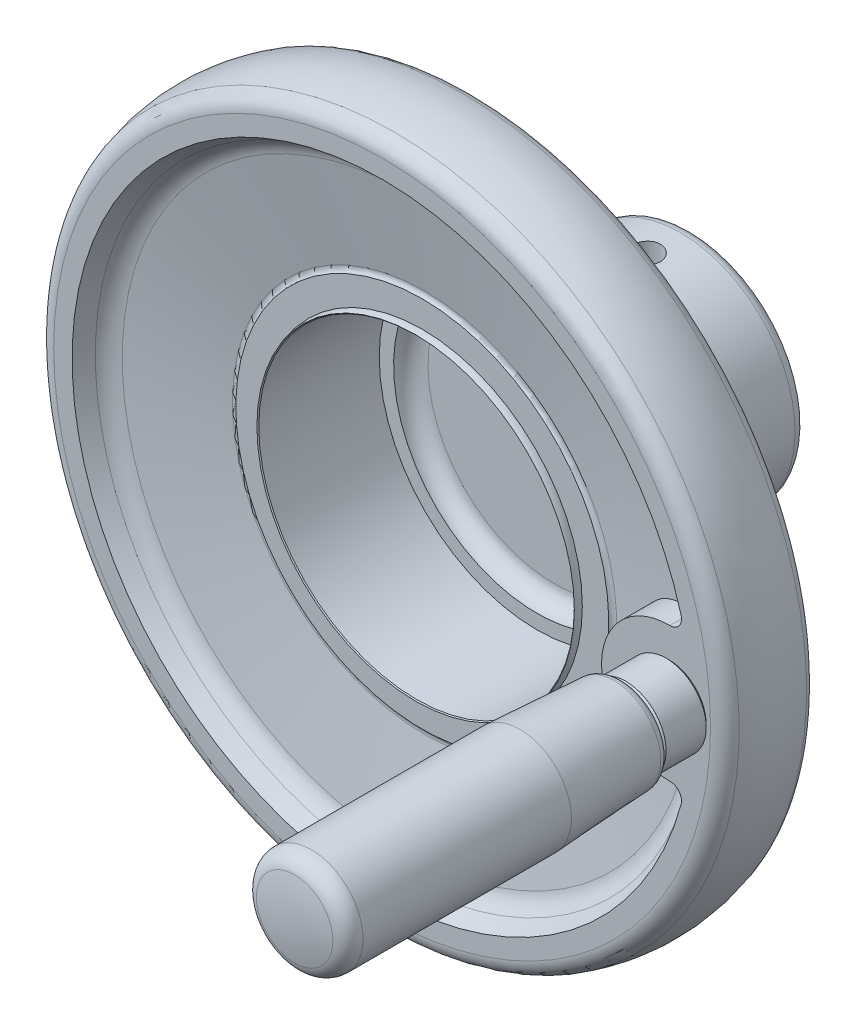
ISO-10303-21;
HEADER;
FILE_DESCRIPTION(('STEP AP214'),'2;1');
FILE_NAME('part.step','',(''),(''),'','','');
FILE_SCHEMA(('AUTOMOTIVE_DESIGN { 1 0 10303 214 1 1 1 1 }'));
ENDSEC;
DATA;
#1=APPLICATION_CONTEXT('core data for automotive mechanical design processes');
#2=APPLICATION_PROTOCOL_DEFINITION('international standard','automotive_design',2000,#1);
#3=PRODUCT_CONTEXT('',#1,'mechanical');
#4=PRODUCT('Part','Part','',(#3));
#5=PRODUCT_RELATED_PRODUCT_CATEGORY('part','',(#4));
#6=PRODUCT_DEFINITION_FORMATION('','',#4);
#7=PRODUCT_DEFINITION_CONTEXT('part definition',#1,'design');
#8=PRODUCT_DEFINITION('design','',#6,#7);
#9=PRODUCT_DEFINITION_SHAPE('','',#8);
#10=(LENGTH_UNIT() NAMED_UNIT(*) SI_UNIT(.MILLI.,.METRE.));
#11=(NAMED_UNIT(*) PLANE_ANGLE_UNIT() SI_UNIT($,.RADIAN.));
#12=(NAMED_UNIT(*) SI_UNIT($,.STERADIAN.) SOLID_ANGLE_UNIT());
#13=UNCERTAINTY_MEASURE_WITH_UNIT(LENGTH_MEASURE(1.E-05),#10,'distance_accuracy_value','');
#14=(GEOMETRIC_REPRESENTATION_CONTEXT(3) GLOBAL_UNCERTAINTY_ASSIGNED_CONTEXT((#13)) GLOBAL_UNIT_ASSIGNED_CONTEXT((#10,
#11,#12)) REPRESENTATION_CONTEXT('',''));
#15=CARTESIAN_POINT('',(0.,0.,0.));
#16=DIRECTION('',(0.,0.,1.));
#17=DIRECTION('',(1.,0.,0.));
#18=AXIS2_PLACEMENT_3D('',#15,#16,#17);
#19=CARTESIAN_POINT('',(0.,0.,-10.));
#20=DIRECTION('',(0.,0.,-1.));
#21=DIRECTION('',(0.,1.,0.));
#22=AXIS2_PLACEMENT_3D('',#19,#20,#21);
#23=CYLINDRICAL_SURFACE('',#22,6.);
#24=CARTESIAN_POINT('',(0.,0.,0.5));
#25=DIRECTION('',(0.,0.,1.));
#26=DIRECTION('',(0.,-1.,0.));
#27=AXIS2_PLACEMENT_3D('',#24,#25,#26);
#28=CIRCLE('',#27,6.);
#29=CARTESIAN_POINT('',(0.,-6.,0.5));
#30=VERTEX_POINT('',#29);
#31=EDGE_CURVE('E255',#30,#30,#28,.F.);
#32=ORIENTED_EDGE('',*,*,#31,.T.);
#33=EDGE_LOOP('',(#32));
#34=FACE_BOUND('',#33,.T.);
#35=CARTESIAN_POINT('',(0.,0.,23.5));
#36=DIRECTION('',(0.,0.,-1.));
#37=DIRECTION('',(0.,1.,0.));
#38=AXIS2_PLACEMENT_3D('',#35,#36,#37);
#39=CIRCLE('',#38,6.);
#40=CARTESIAN_POINT('',(0.,6.,23.5));
#41=VERTEX_POINT('',#40);
#42=EDGE_CURVE('E137',#41,#41,#39,.F.);
#43=ORIENTED_EDGE('',*,*,#42,.T.);
#44=EDGE_LOOP('',(#43));
#45=FACE_BOUND('',#44,.T.);
#46=CARTESIAN_POINT('',(-5.45435605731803,-2.50000000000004,8.));
#47=CARTESIAN_POINT('',(-5.45435734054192,-2.49999850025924,7.9332918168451));
#48=CARTESIAN_POINT('',(-5.45558543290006,-2.49732449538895,7.86656520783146));
#49=CARTESIAN_POINT('',(-5.46045125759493,-2.48666416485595,7.73361352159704));
#50=CARTESIAN_POINT('',(-5.46409042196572,-2.47867468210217,7.66738876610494));
#51=CARTESIAN_POINT('',(-5.47848490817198,-2.44679265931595,7.46994813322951));
#52=CARTESIAN_POINT('',(-5.49271671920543,-2.41498683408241,7.3401631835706));
#53=CARTESIAN_POINT('',(-5.52853615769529,-2.33180001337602,7.08884523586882));
#54=CARTESIAN_POINT('',(-5.55009376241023,-2.280498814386,6.96728094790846));
#55=CARTESIAN_POINT('',(-5.59808356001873,-2.16001268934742,6.73448982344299));
#56=CARTESIAN_POINT('',(-5.62451459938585,-2.09083199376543,6.62326055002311));
#57=CARTESIAN_POINT('',(-5.68111508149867,-1.93194778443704,6.40734601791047));
#58=CARTESIAN_POINT('',(-5.7114113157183,-1.84130648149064,6.30338420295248));
#59=CARTESIAN_POINT('',(-5.77128595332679,-1.64404334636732,6.11160023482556));
#60=CARTESIAN_POINT('',(-5.80086407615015,-1.53741538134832,6.02378430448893));
#61=CARTESIAN_POINT('',(-5.85751074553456,-1.30552678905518,5.86310074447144));
#62=CARTESIAN_POINT('',(-5.88441479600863,-1.17965858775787,5.79104669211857));
#63=CARTESIAN_POINT('',(-5.93113040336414,-0.916264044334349,5.66944801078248));
#64=CARTESIAN_POINT('',(-5.95094510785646,-0.778742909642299,5.61989338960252));
#65=CARTESIAN_POINT('',(-5.9803504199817,-0.503536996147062,5.54732106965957));
#66=CARTESIAN_POINT('',(-5.99041942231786,-0.366233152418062,5.52305660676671));
#67=CARTESIAN_POINT('',(-6.00093657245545,-0.0891583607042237,5.4977247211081));
#68=CARTESIAN_POINT('',(-6.00138862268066,0.050611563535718,5.49664788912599));
#69=CARTESIAN_POINT('',(-5.99290258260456,0.319585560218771,5.51706856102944));
#70=CARTESIAN_POINT('',(-5.98453429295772,0.448914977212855,5.537196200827));
#71=CARTESIAN_POINT('',(-5.96013033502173,0.702165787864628,5.59710620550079));
#72=CARTESIAN_POINT('',(-5.94409410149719,0.826086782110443,5.63689001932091));
#73=CARTESIAN_POINT('',(-5.90559704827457,1.06727623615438,5.73545608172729));
#74=CARTESIAN_POINT('',(-5.88304194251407,1.18441435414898,5.79451892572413));
#75=CARTESIAN_POINT('',(-5.83371427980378,1.40742353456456,5.9296915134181));
#76=CARTESIAN_POINT('',(-5.8069402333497,1.51329059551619,6.00580728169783));
#77=CARTESIAN_POINT('',(-5.74963397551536,1.71868182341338,6.17916484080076));
#78=CARTESIAN_POINT('',(-5.71896988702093,1.81723287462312,6.27751758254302));
#79=CARTESIAN_POINT('',(-5.65875721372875,1.99686282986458,6.48942288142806));
#80=CARTESIAN_POINT('',(-5.62920906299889,2.07793499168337,6.60298127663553));
#81=CARTESIAN_POINT('',(-5.57363224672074,2.22280378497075,6.84679007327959));
#82=CARTESIAN_POINT('',(-5.54775116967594,2.28594506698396,6.97746641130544));
#83=CARTESIAN_POINT('',(-5.50419688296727,2.38892864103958,7.24896208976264));
#84=CARTESIAN_POINT('',(-5.48651780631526,2.42878759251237,7.38977409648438));
#85=CARTESIAN_POINT('',(-5.46282425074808,2.48160050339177,7.66779361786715));
#86=CARTESIAN_POINT('',(-5.45612738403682,2.49613229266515,7.80464224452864));
#87=CARTESIAN_POINT('',(-5.4532057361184,2.50251261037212,8.07895696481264));
#88=CARTESIAN_POINT('',(-5.45697733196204,2.49436898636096,8.21642282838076));
#89=CARTESIAN_POINT('',(-5.47386262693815,2.45706955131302,8.47879677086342));
#90=CARTESIAN_POINT('',(-5.48636276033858,2.42929237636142,8.60394537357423));
#91=CARTESIAN_POINT('',(-5.51851260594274,2.35534117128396,8.84770259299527));
#92=CARTESIAN_POINT('',(-5.53816398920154,2.3091628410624,8.96630967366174));
#93=CARTESIAN_POINT('',(-5.5834159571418,2.19755041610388,9.19923062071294));
#94=CARTESIAN_POINT('',(-5.60923324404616,2.13138366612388,9.31314994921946));
#95=CARTESIAN_POINT('',(-5.6636000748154,1.98240156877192,9.52881610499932));
#96=CARTESIAN_POINT('',(-5.69215079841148,1.89957901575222,9.63055763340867));
#97=CARTESIAN_POINT('',(-5.75157239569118,1.71168891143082,9.82760026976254));
#98=CARTESIAN_POINT('',(-5.7824429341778,1.6053593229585,9.92170279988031));
#99=CARTESIAN_POINT('',(-5.84086722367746,1.37770302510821,10.0909445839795));
#100=CARTESIAN_POINT('',(-5.86842073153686,1.25637521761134,10.1660824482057));
#101=CARTESIAN_POINT('',(-5.91728503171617,1.00130936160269,10.2951797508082));
#102=CARTESIAN_POINT('',(-5.93857966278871,0.867540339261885,10.3490844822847));
#103=CARTESIAN_POINT('',(-5.97236346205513,0.591717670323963,10.4332335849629));
#104=CARTESIAN_POINT('',(-5.98485787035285,0.449669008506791,10.4634920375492));
#105=CARTESIAN_POINT('',(-5.99903069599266,0.172033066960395,10.4977162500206));
#106=CARTESIAN_POINT('',(-6.00140409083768,0.0366881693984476,10.5033719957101));
#107=CARTESIAN_POINT('',(-5.99699046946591,-0.232973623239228,10.4927737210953));
#108=CARTESIAN_POINT('',(-5.99020505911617,-0.36729069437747,10.4765235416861));
#109=CARTESIAN_POINT('',(-5.96860132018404,-0.626172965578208,10.4237878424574));
#110=CARTESIAN_POINT('',(-5.95407648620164,-0.750915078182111,10.3880405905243));
#111=CARTESIAN_POINT('',(-5.9185899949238,-0.99258445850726,10.2981315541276));
#112=CARTESIAN_POINT('',(-5.8976271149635,-1.10951023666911,10.2439662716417));
#113=CARTESIAN_POINT('',(-5.85011651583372,-1.33804914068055,10.1160207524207));
#114=CARTESIAN_POINT('',(-5.82335921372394,-1.44918335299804,10.0414646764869));
#115=CARTESIAN_POINT('',(-5.76743120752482,-1.65783731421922,9.87598635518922));
#116=CARTESIAN_POINT('',(-5.73825960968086,-1.75535198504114,9.78505803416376));
#117=CARTESIAN_POINT('',(-5.6782970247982,-1.94089972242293,9.58210746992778));
#118=CARTESIAN_POINT('',(-5.64753091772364,-2.02783607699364,9.46907088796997));
#119=CARTESIAN_POINT('',(-5.58991059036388,-2.18166607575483,9.22909360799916));
#120=CARTESIAN_POINT('',(-5.56305856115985,-2.24854851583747,9.10214519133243));
#121=CARTESIAN_POINT('',(-5.51685287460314,-2.35965744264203,8.83807106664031));
#122=CARTESIAN_POINT('',(-5.49745949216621,-2.404004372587,8.70100404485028));
#123=CARTESIAN_POINT('',(-5.47594959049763,-2.45239925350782,8.49083623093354));
#124=CARTESIAN_POINT('',(-5.47004503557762,-2.4655060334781,8.42008940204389));
#125=CARTESIAN_POINT('',(-5.46095373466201,-2.4855813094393,8.27757394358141));
#126=CARTESIAN_POINT('',(-5.45776506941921,-2.492554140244,8.20580607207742));
#127=CARTESIAN_POINT('',(-5.45490391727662,-2.49880479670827,8.08928839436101));
#128=CARTESIAN_POINT('',(-5.45435519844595,-2.50000100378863,8.04464832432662));
#129=CARTESIAN_POINT('',(-5.45435605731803,-2.50000000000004,8.));
#130=B_SPLINE_CURVE_WITH_KNOTS('',3,(#46,#47,#48,#49,#50,#51,#52,#53,#54,#55,#56,#57,#58,#59,
#60,#61,#62,#63,#64,#65,#66,#67,#68,#69,#70,#71,#72,#73,#74,#75,#76,#77,#78,#79,#80,#81,#82,#83,
#84,#85,#86,#87,#88,#89,#90,#91,#92,#93,#94,#95,#96,#97,#98,#99,#100,#101,#102,#103,#104,#105,
#106,#107,#108,#109,#110,#111,#112,#113,#114,#115,#116,#117,#118,#119,#120,#121,#122,#123,#124,
#125,#126,#127,#128,#129),.UNSPECIFIED.,.T.,.F.,(4,2,2,2,2,2,2,2,2,2,2,2,2,2,2,2,2,2,2,2,2,2,2,
2,2,2,2,2,2,2,2,2,2,2,2,2,2,2,2,2,2,4),(0.,0.200084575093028,0.400288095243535,
0.801278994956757,1.20064597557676,1.59991854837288,2.02172149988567,2.44368668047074,
2.88395420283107,3.32402600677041,3.74119679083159,4.15819828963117,4.54982147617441,
4.94147353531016,5.33910096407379,5.7368690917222,6.16267530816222,6.58864548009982,
7.02861558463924,7.46827048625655,7.87940023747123,8.29038772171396,8.67506269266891,
9.05982760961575,9.46088720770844,9.86212068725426,10.2960179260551,10.7299469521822,
11.1649867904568,11.5997673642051,12.004157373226,12.4084764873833,12.7984529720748,
13.1885035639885,13.5961819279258,14.0040118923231,14.4395932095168,14.8754174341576,
15.308887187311,15.5252058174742,15.7413714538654,15.8752896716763),.UNSPECIFIED.);
#131=CARTESIAN_POINT('',(-5.45435605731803,-2.50000000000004,8.));
#132=VERTEX_POINT('',#131);
#133=EDGE_CURVE('E173',#132,#132,#130,.T.);
#134=ORIENTED_EDGE('',*,*,#133,.F.);
#135=EDGE_LOOP('',(#134));
#136=FACE_BOUND('',#135,.T.);
#137=CARTESIAN_POINT('',(0.,6.,10.5));
#138=CARTESIAN_POINT('',(-0.133903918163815,5.99999628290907,10.4999952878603));
#139=CARTESIAN_POINT('',(-0.268039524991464,5.99546656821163,10.4891786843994));
#140=CARTESIAN_POINT('',(-0.532498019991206,5.97780115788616,10.4463192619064));
#141=CARTESIAN_POINT('',(-0.6628100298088,5.96464300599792,10.4142210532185));
#142=CARTESIAN_POINT('',(-0.915376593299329,5.93112629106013,10.3301785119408));
#143=CARTESIAN_POINT('',(-1.03765681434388,5.9107921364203,10.278301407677));
#144=CARTESIAN_POINT('',(-1.2716597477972,5.86490559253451,10.1564541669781));
#145=CARTESIAN_POINT('',(-1.38338564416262,5.83935478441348,10.0864895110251));
#146=CARTESIAN_POINT('',(-1.59889674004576,5.78415660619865,9.92674208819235));
#147=CARTESIAN_POINT('',(-1.70208251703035,5.75437507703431,9.83619739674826));
#148=CARTESIAN_POINT('',(-1.89231966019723,5.69465427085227,9.63947131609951));
#149=CARTESIAN_POINT('',(-1.97936253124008,5.66471491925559,9.53328174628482));
#150=CARTESIAN_POINT('',(-2.13907474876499,5.60642043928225,9.30194644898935));
#151=CARTESIAN_POINT('',(-2.2108261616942,5.57821573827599,9.17612510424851));
#152=CARTESIAN_POINT('',(-2.33187881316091,5.52871144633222,8.91285348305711));
#153=CARTESIAN_POINT('',(-2.38119161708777,5.50740829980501,8.77540924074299));
#154=CARTESIAN_POINT('',(-2.45349196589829,5.47557110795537,8.49969261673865));
#155=CARTESIAN_POINT('',(-2.47763315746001,5.46456775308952,8.36177903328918));
#156=CARTESIAN_POINT('',(-2.50250419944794,5.45322652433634,8.08345341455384));
#157=CARTESIAN_POINT('',(-2.50324696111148,5.45288276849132,7.94304279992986));
#158=CARTESIAN_POINT('',(-2.48216900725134,5.46250239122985,7.67519987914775));
#159=CARTESIAN_POINT('',(-2.46207362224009,5.47167765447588,7.54759780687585));
#160=CARTESIAN_POINT('',(-2.40278382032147,5.49796965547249,7.2977758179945));
#161=CARTESIAN_POINT('',(-2.36358574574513,5.51508791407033,7.17555693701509));
#162=CARTESIAN_POINT('',(-2.26643917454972,5.55572369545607,6.93688459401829));
#163=CARTESIAN_POINT('',(-2.20810943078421,5.579369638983,6.8206091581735));
#164=CARTESIAN_POINT('',(-2.07462485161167,5.63036662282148,6.59904453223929));
#165=CARTESIAN_POINT('',(-1.99946338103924,5.65771912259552,6.49375969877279));
#166=CARTESIAN_POINT('',(-1.82699193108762,5.71585953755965,6.28780008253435));
#167=CARTESIAN_POINT('',(-1.72834696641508,5.74674242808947,6.18826686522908));
#168=CARTESIAN_POINT('',(-1.515459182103,5.80651346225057,6.00677299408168));
#169=CARTESIAN_POINT('',(-1.40121271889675,5.83540113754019,5.92481645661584));
#170=CARTESIAN_POINT('',(-1.15689589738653,5.88876567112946,5.77912835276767));
#171=CARTESIAN_POINT('',(-1.02652116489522,5.91312533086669,5.71586110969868));
#172=CARTESIAN_POINT('',(-0.755704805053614,5.95378962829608,5.61255772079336));
#173=CARTESIAN_POINT('',(-0.615268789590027,5.97009871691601,5.57250873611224));
#174=CARTESIAN_POINT('',(-0.337856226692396,5.9919928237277,5.51916801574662));
#175=CARTESIAN_POINT('',(-0.201222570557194,5.9981908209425,5.50434428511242));
#176=CARTESIAN_POINT('',(0.0727093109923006,6.0011210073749,5.49730755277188));
#177=CARTESIAN_POINT('',(0.210007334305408,5.9978559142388,5.50508805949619));
#178=CARTESIAN_POINT('',(0.47419648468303,5.98262435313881,5.54194216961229));
#179=CARTESIAN_POINT('',(0.60126593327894,5.97109774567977,5.56993990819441));
#180=CARTESIAN_POINT('',(0.848765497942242,5.94097213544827,5.64493638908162));
#181=CARTESIAN_POINT('',(0.969194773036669,5.92237223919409,5.69193753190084));
#182=CARTESIAN_POINT('',(1.20421799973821,5.87916541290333,5.80514195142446));
#183=CARTESIAN_POINT('',(1.31851447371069,5.85438982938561,5.87189636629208));
#184=CARTESIAN_POINT('',(1.53469243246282,5.80147609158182,6.02210675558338));
#185=CARTESIAN_POINT('',(1.63656870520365,5.77333653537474,6.10556970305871));
#186=CARTESIAN_POINT('',(1.83266686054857,5.71424175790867,6.29380646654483));
#187=CARTESIAN_POINT('',(1.92582139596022,5.68322903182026,6.39967700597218));
#188=CARTESIAN_POINT('',(2.09333969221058,5.62368673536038,6.62604255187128));
#189=CARTESIAN_POINT('',(2.16769918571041,5.59515772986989,6.74654087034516));
#190=CARTESIAN_POINT('',(2.29631920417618,5.54362772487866,7.00122835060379));
#191=CARTESIAN_POINT('',(2.35027836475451,5.520711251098,7.13558807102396));
#192=CARTESIAN_POINT('',(2.43434827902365,5.48416711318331,7.41274118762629));
#193=CARTESIAN_POINT('',(2.46447869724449,5.47053179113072,7.55552752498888));
#194=CARTESIAN_POINT('',(2.4980816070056,5.45526329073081,7.83363739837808));
#195=CARTESIAN_POINT('',(2.50342760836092,5.45278701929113,7.96868932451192));
#196=CARTESIAN_POINT('',(2.49231151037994,5.45787706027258,8.23768572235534));
#197=CARTESIAN_POINT('',(2.47585275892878,5.46544183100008,8.3716303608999));
#198=CARTESIAN_POINT('',(2.42316809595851,5.48899102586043,8.62818549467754));
#199=CARTESIAN_POINT('',(2.38789807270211,5.5045670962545,8.75103334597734));
#200=CARTESIAN_POINT('',(2.29952656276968,5.54206362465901,8.98909604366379));
#201=CARTESIAN_POINT('',(2.24642006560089,5.56398586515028,9.10430873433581));
#202=CARTESIAN_POINT('',(2.12020572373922,5.61333908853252,9.33139178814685));
#203=CARTESIAN_POINT('',(2.04608723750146,5.64102204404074,9.44264464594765));
#204=CARTESIAN_POINT('',(1.88136812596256,5.69807379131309,9.65172029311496));
#205=CARTESIAN_POINT('',(1.79076178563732,5.72744316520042,9.74953840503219));
#206=CARTESIAN_POINT('',(1.58780416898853,5.78712781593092,9.93629730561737));
#207=CARTESIAN_POINT('',(1.47434977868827,5.81735619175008,10.0240726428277));
#208=CARTESIAN_POINT('',(1.23319985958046,5.8732030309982,10.1793991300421));
#209=CARTESIAN_POINT('',(1.10549787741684,5.89881939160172,10.2469410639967));
#210=CARTESIAN_POINT('',(0.841465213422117,5.94218308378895,10.3584188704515));
#211=CARTESIAN_POINT('',(0.70531205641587,5.96005349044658,10.4027264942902));
#212=CARTESIAN_POINT('',(0.426816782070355,5.9864223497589,10.4674156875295));
#213=CARTESIAN_POINT('',(0.28449550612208,5.99495014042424,10.4878721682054));
#214=CARTESIAN_POINT('',(0.118052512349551,5.99888566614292,10.4973238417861));
#215=CARTESIAN_POINT('',(0.0944569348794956,5.99930292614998,10.498326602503));
#216=CARTESIAN_POINT('',(0.0472433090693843,5.99986042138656,10.4996650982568));
#217=CARTESIAN_POINT('',(0.0236252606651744,6.0000006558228,10.5000008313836));
#218=CARTESIAN_POINT('',(0.,6.,10.5));
#219=B_SPLINE_CURVE_WITH_KNOTS('',3,(#137,#138,#139,#140,#141,#142,#143,#144,#145,#146,#147,
#148,#149,#150,#151,#152,#153,#154,#155,#156,#157,#158,#159,#160,#161,#162,#163,#164,#165,#166,
#167,#168,#169,#170,#171,#172,#173,#174,#175,#176,#177,#178,#179,#180,#181,#182,#183,#184,#185,
#186,#187,#188,#189,#190,#191,#192,#193,#194,#195,#196,#197,#198,#199,#200,#201,#202,#203,#204,
#205,#206,#207,#208,#209,#210,#211,#212,#213,#214,#215,#216,#217,#218),.UNSPECIFIED.,.T.,.F.,(4,
2,2,2,2,2,2,2,2,2,2,2,2,2,2,2,2,2,2,2,2,2,2,2,2,2,2,2,2,2,2,2,2,2,2,2,2,2,2,2,4),(0.,
0.401613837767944,0.804277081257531,1.20558370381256,1.60676887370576,2.02635872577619,
2.44616876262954,2.8866344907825,3.32687293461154,3.74590546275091,4.16470676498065,
4.55140314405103,4.93817359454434,5.33317426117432,5.72833091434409,6.15688282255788,
6.58553498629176,7.02408110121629,7.46238448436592,7.87296886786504,8.28343534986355,
8.67353179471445,9.06367753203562,9.46594270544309,9.86837610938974,10.2995697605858,
10.7308612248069,11.1682957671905,11.6053689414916,12.0087975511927,12.4121642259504,
12.796752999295,13.181449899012,13.5892778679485,13.9972474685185,14.4349307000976,
14.8728129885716,15.3034571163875,15.7327450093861,15.8036033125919,15.8744618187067),.UNSPECIFIED.);
#220=CARTESIAN_POINT('',(0.,6.,10.5));
#221=VERTEX_POINT('',#220);
#222=EDGE_CURVE('E181',#221,#221,#219,.T.);
#223=ORIENTED_EDGE('',*,*,#222,.F.);
#224=EDGE_LOOP('',(#223));
#225=FACE_BOUND('',#224,.T.);
#226=ADVANCED_FACE('F14',(#34,#45,#136,#225),#23,.F.);
#227=CARTESIAN_POINT('',(0.,0.,47.));
#228=DIRECTION('',(0.,0.,-1.));
#229=DIRECTION('',(0.,1.,0.));
#230=AXIS2_PLACEMENT_3D('',#227,#228,#229);
#231=TOROIDAL_SURFACE('',#230,24.9,3.);
#232=CARTESIAN_POINT('',(0.,0.,48.1623395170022));
#233=DIRECTION('',(0.,0.,-1.));
#234=DIRECTION('',(0.,1.,0.));
#235=AXIS2_PLACEMENT_3D('',#232,#233,#234);
#236=CIRCLE('',#235,27.6656765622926);
#237=CARTESIAN_POINT('',(0.,27.6656765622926,48.1623395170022));
#238=VERTEX_POINT('',#237);
#239=EDGE_CURVE('E22',#238,#238,#236,.T.);
#240=ORIENTED_EDGE('',*,*,#239,.T.);
#241=EDGE_LOOP('',(#240));
#242=FACE_BOUND('',#241,.T.);
#243=CARTESIAN_POINT('',(0.,0.,47.));
#244=DIRECTION('',(0.,0.,-1.));
#245=DIRECTION('',(0.,1.,0.));
#246=AXIS2_PLACEMENT_3D('',#243,#244,#245);
#247=CIRCLE('',#246,27.9);
#248=CARTESIAN_POINT('',(0.,27.9,47.));
#249=VERTEX_POINT('',#248);
#250=EDGE_CURVE('E225',#249,#249,#247,.T.);
#251=ORIENTED_EDGE('',*,*,#250,.F.);
#252=EDGE_LOOP('',(#251));
#253=FACE_BOUND('',#252,.T.);
#254=ADVANCED_FACE('F244',(#242,#253),#231,.T.);
#255=CARTESIAN_POINT('',(-27.9,0.,47.));
#256=DIRECTION('',(0.,0.,-1.));
#257=DIRECTION('',(0.,1.,0.));
#258=AXIS2_PLACEMENT_3D('',#255,#256,#257);
#259=PLANE('',#258);
#260=CARTESIAN_POINT('',(0.,0.,46.9999999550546));
#261=DIRECTION('',(0.,0.,-1.));
#262=DIRECTION('',(0.,1.,0.));
#263=AXIS2_PLACEMENT_3D('',#260,#261,#262);
#264=CIRCLE('',#263,32.4999999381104);
#265=CARTESIAN_POINT('',(0.,32.4999999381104,46.9999999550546));
#266=VERTEX_POINT('',#265);
#267=EDGE_CURVE('E306',#266,#266,#264,.T.);
#268=ORIENTED_EDGE('',*,*,#267,.F.);
#269=EDGE_LOOP('',(#268));
#270=FACE_BOUND('',#269,.T.);
#271=ORIENTED_EDGE('',*,*,#250,.T.);
#272=EDGE_LOOP('',(#271));
#273=FACE_BOUND('',#272,.T.);
#274=ADVANCED_FACE('F250',(#270,#273),#259,.F.);
#275=CARTESIAN_POINT('',(0.,0.,47.587615));
#276=DIRECTION('',(0.,0.,-1.));
#277=DIRECTION('',(0.,1.,0.));
#278=AXIS2_PLACEMENT_3D('',#275,#276,#277);
#279=TOROIDAL_SURFACE('',#278,33.309141,1.00000034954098);
#280=ORIENTED_EDGE('',*,*,#267,.T.);
#281=EDGE_LOOP('',(#280));
#282=FACE_BOUND('',#281,.T.);
#283=CARTESIAN_POINT('',(0.,0.,46.603052));
#284=DIRECTION('',(0.,0.,-1.));
#285=DIRECTION('',(0.,1.,0.));
#286=AXIS2_PLACEMENT_3D('',#283,#284,#285);
#287=CIRCLE('',#286,33.484174);
#288=CARTESIAN_POINT('',(0.,33.484174,46.603052));
#289=VERTEX_POINT('',#288);
#290=EDGE_CURVE('E304',#289,#289,#287,.T.);
#291=ORIENTED_EDGE('',*,*,#290,.F.);
#292=EDGE_LOOP('',(#291));
#293=FACE_BOUND('',#292,.T.);
#294=ADVANCED_FACE('F315',(#282,#293),#279,.F.);
#295=CARTESIAN_POINT('',(0.,0.,49.5037552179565));
#296=DIRECTION('',(0.,0.,1.));
#297=DIRECTION('',(0.,-1.,0.));
#298=AXIS2_PLACEMENT_3D('',#295,#296,#297);
#299=CONICAL_SURFACE('',#298,49.8006239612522,1.39485664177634);
#300=CARTESIAN_POINT('',(48.4215169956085,11.643491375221,49.503955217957));
#301=CARTESIAN_POINT('',(48.0896876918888,11.5985391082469,49.4447345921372));
#302=CARTESIAN_POINT('',(47.7598397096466,11.5393450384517,49.3852614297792));
#303=CARTESIAN_POINT('',(47.1064166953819,11.3930485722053,49.2662358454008));
#304=CARTESIAN_POINT('',(46.7828414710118,11.3059470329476,49.2066834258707));
#305=CARTESIAN_POINT('',(46.1443410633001,11.1044356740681,49.0879377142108));
#306=CARTESIAN_POINT('',(45.8294135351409,10.9900333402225,49.0287443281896));
#307=CARTESIAN_POINT('',(45.2103510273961,10.7347032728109,48.9111582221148));
#308=CARTESIAN_POINT('',(44.9062158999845,10.5937759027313,48.8527654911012));
#309=CARTESIAN_POINT('',(44.3107341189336,10.2862584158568,48.7372292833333));
#310=CARTESIAN_POINT('',(44.0193947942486,10.1196538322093,48.680086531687));
#311=CARTESIAN_POINT('',(43.4517882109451,9.76196442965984,48.5675944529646));
#312=CARTESIAN_POINT('',(43.175520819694,9.57087982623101,48.5122451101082));
#313=CARTESIAN_POINT('',(42.6401389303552,9.16556838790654,48.403886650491));
#314=CARTESIAN_POINT('',(42.3810200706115,8.95134747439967,48.3508769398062));
#315=CARTESIAN_POINT('',(41.8817808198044,8.50117567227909,48.2477364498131));
#316=CARTESIAN_POINT('',(41.6416602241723,8.26522501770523,48.197605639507));
#317=CARTESIAN_POINT('',(41.1836975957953,7.77477718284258,48.1010988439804));
#318=CARTESIAN_POINT('',(40.9657232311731,7.52040789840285,48.0547009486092));
#319=CARTESIAN_POINT('',(40.5519875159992,6.99355034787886,47.9658685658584));
#320=CARTESIAN_POINT('',(40.3562261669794,6.72106208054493,47.9234340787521));
#321=CARTESIAN_POINT('',(39.9884399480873,6.15984820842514,47.8430806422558));
#322=CARTESIAN_POINT('',(39.8164168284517,5.87112140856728,47.8051620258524));
#323=CARTESIAN_POINT('',(39.4975140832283,5.27950842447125,47.7343779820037));
#324=CARTESIAN_POINT('',(39.3506340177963,4.97662248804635,47.7015124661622));
#325=CARTESIAN_POINT('',(39.0858647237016,4.36497572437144,47.6419207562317));
#326=CARTESIAN_POINT('',(38.9674621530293,4.05644758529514,47.6150865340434));
#327=CARTESIAN_POINT('',(38.756958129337,3.43011025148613,47.5671602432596));
#328=CARTESIAN_POINT('',(38.6648563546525,3.11230117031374,47.5460681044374));
#329=CARTESIAN_POINT('',(38.5077391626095,2.46977770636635,47.5099683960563));
#330=CARTESIAN_POINT('',(38.4427188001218,2.14506459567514,47.4949597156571));
#331=CARTESIAN_POINT('',(38.3402955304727,1.49108397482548,47.4712720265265));
#332=CARTESIAN_POINT('',(38.3028922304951,1.16181652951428,47.4625929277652));
#333=CARTESIAN_POINT('',(38.2565265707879,0.508274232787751,47.451828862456));
#334=CARTESIAN_POINT('',(38.2469722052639,0.184043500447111,47.4496066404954));
#335=CARTESIAN_POINT('',(38.2546963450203,-0.464077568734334,47.4514016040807));
#336=CARTESIAN_POINT('',(38.2719744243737,-0.787967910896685,47.4554186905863));
#337=CARTESIAN_POINT('',(38.3332184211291,-1.43306747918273,47.4696255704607));
#338=CARTESIAN_POINT('',(38.3771835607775,-1.75427678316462,47.4798151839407));
#339=CARTESIAN_POINT('',(38.4914383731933,-2.39172716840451,47.5062010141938));
#340=CARTESIAN_POINT('',(38.5617280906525,-2.70796824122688,47.5223972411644));
#341=CARTESIAN_POINT('',(38.7275840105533,-3.33145710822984,47.5604304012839));
#342=CARTESIAN_POINT('',(38.8230034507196,-3.63874597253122,47.5822345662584));
#343=CARTESIAN_POINT('',(39.0385474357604,-4.24408796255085,47.6311983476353));
#344=CARTESIAN_POINT('',(39.1586718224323,-4.54214114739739,47.6583579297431));
#345=CARTESIAN_POINT('',(39.4227046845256,-5.12701433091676,47.7176439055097));
#346=CARTESIAN_POINT('',(39.5666139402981,-5.41383396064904,47.7497704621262));
#347=CARTESIAN_POINT('',(39.8771335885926,-5.97433904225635,47.8185547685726));
#348=CARTESIAN_POINT('',(40.0437442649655,-6.2480243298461,47.8552125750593));
#349=CARTESIAN_POINT('',(40.4011254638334,-6.78450816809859,47.9331780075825));
#350=CARTESIAN_POINT('',(40.5922224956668,-7.04708024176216,47.9745474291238));
#351=CARTESIAN_POINT('',(40.9951509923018,-7.55515194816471,48.0609716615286));
#352=CARTESIAN_POINT('',(41.2069827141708,-7.80065136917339,48.1060265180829));
#353=CARTESIAN_POINT('',(41.6499140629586,-8.27305423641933,48.1993225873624));
#354=CARTESIAN_POINT('',(41.8810180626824,-8.49995343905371,48.2475645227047));
#355=CARTESIAN_POINT('',(42.36083053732,-8.93365388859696,48.3467196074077));
#356=CARTESIAN_POINT('',(42.6095389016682,-9.14045526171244,48.3976327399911));
#357=CARTESIAN_POINT('',(43.128682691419,-9.53711765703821,48.5028181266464));
#358=CARTESIAN_POINT('',(43.39948295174,-9.7264881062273,48.5571403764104));
#359=CARTESIAN_POINT('',(43.9558036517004,-10.0816219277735,48.6675549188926));
#360=CARTESIAN_POINT('',(44.2413243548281,-10.2473848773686,48.7236472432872));
#361=CARTESIAN_POINT('',(44.8249190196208,-10.5541286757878,48.837080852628));
#362=CARTESIAN_POINT('',(45.1229853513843,-10.6951243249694,48.8944213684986));
#363=CARTESIAN_POINT('',(45.7296683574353,-10.9514933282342,49.0099029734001));
#364=CARTESIAN_POINT('',(46.0382816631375,-11.0668747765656,49.068043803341));
#365=CARTESIAN_POINT('',(46.6884497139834,-11.2792705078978,49.1892575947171));
#366=CARTESIAN_POINT('',(47.0306972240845,-11.374152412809,49.2523617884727));
#367=CARTESIAN_POINT('',(47.7217421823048,-11.5324646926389,49.3783911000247));
#368=CARTESIAN_POINT('',(48.0705265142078,-11.5959522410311,49.4413163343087));
#369=CARTESIAN_POINT('',(48.4215169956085,-11.6434913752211,49.503955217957));
#370=B_SPLINE_CURVE_WITH_KNOTS('',3,(#300,#301,#302,#303,#304,#305,#306,#307,#308,#309,#310,
#311,#312,#313,#314,#315,#316,#317,#318,#319,#320,#321,#322,#323,#324,#325,#326,#327,#328,#329,
#330,#331,#332,#333,#334,#335,#336,#337,#338,#339,#340,#341,#342,#343,#344,#345,#346,#347,#348,
#349,#350,#351,#352,#353,#354,#355,#356,#357,#358,#359,#360,#361,#362,#363,#364,#365,#366,#367,
#368,#369),.UNSPECIFIED.,.F.,.F.,(4,2,2,2,2,2,2,2,2,2,2,2,2,2,2,2,2,2,2,2,2,2,2,2,2,2,2,2,2,2,2,
2,2,2,4),(0.,1.01985979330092,2.03968826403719,3.05923742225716,4.07877261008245,
5.09888433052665,6.11898707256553,7.13882935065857,8.15866064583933,9.17198708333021,
10.1853135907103,11.1987147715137,12.2120982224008,13.2055518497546,14.1989933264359,
15.1922533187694,16.1854991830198,17.1574711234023,18.1294276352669,19.1013558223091,
20.0732856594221,21.0396604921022,22.0060291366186,22.972429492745,23.9388419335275,
24.9198312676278,25.9008327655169,26.8820574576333,27.8632759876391,28.8667482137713,
29.87023840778,30.8731268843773,31.8756979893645,32.9564078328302,34.0351422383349),.UNSPECIFIED.);
#371=CARTESIAN_POINT('',(48.4203964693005,11.6433394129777,49.5037552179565));
#372=VERTEX_POINT('',#371);
#373=CARTESIAN_POINT('',(48.4203964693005,-11.6433394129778,49.5037552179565));
#374=VERTEX_POINT('',#373);
#375=EDGE_CURVE('E162',#372,#374,#370,.T.);
#376=ORIENTED_EDGE('',*,*,#375,.F.);
#377=CARTESIAN_POINT('',(0.,0.,49.5037552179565));
#378=DIRECTION('',(0.,0.,-1.));
#379=DIRECTION('',(0.,1.,0.));
#380=AXIS2_PLACEMENT_3D('',#377,#378,#379);
#381=CIRCLE('',#380,49.8006239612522);
#382=EDGE_CURVE('E301',#374,#372,#381,.T.);
#383=ORIENTED_EDGE('',*,*,#382,.F.);
#384=EDGE_LOOP('',(#376,#383));
#385=FACE_BOUND('',#384,.T.);
#386=ORIENTED_EDGE('',*,*,#290,.T.);
#387=EDGE_LOOP('',(#386));
#388=FACE_BOUND('',#387,.T.);
#389=ADVANCED_FACE('F149',(#385,#388),#299,.F.);
#390=CARTESIAN_POINT('',(0.,0.,53.442005));
#391=DIRECTION('',(0.,0.,-1.));
#392=DIRECTION('',(0.,1.,0.));
#393=AXIS2_PLACEMENT_3D('',#390,#391,#392);
#394=TOROIDAL_SURFACE('',#393,49.100491,3.99999968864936);
#395=CARTESIAN_POINT('',(50.1643022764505,-11.7488512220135,50.258075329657));
#396=CARTESIAN_POINT('',(50.2339497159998,-11.7478702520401,50.309433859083));
#397=CARTESIAN_POINT('',(50.3015858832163,-11.7505512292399,50.3634183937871));
#398=CARTESIAN_POINT('',(50.4321760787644,-11.7619864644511,50.4759530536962));
#399=CARTESIAN_POINT('',(50.4951394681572,-11.7707281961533,50.5344935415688));
#400=CARTESIAN_POINT('',(50.6148051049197,-11.7928170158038,50.6544563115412));
#401=CARTESIAN_POINT('',(50.6716075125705,-11.8060683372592,50.7157973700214));
#402=CARTESIAN_POINT('',(50.7801961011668,-11.8361175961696,50.8419614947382));
#403=CARTESIAN_POINT('',(50.8319809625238,-11.8529164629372,50.9067854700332));
#404=CARTESIAN_POINT('',(50.9362554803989,-11.8911616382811,51.0473094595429));
#405=CARTESIAN_POINT('',(50.9881114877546,-11.9129221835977,51.1233918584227));
#406=CARTESIAN_POINT('',(51.0861099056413,-11.9585655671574,51.2798537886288));
#407=CARTESIAN_POINT('',(51.1321794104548,-11.9824700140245,51.3602728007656));
#408=CARTESIAN_POINT('',(51.175078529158,-12.006657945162,51.442205));
#409=B_SPLINE_CURVE_WITH_KNOTS('',3,(#395,#396,#397,#398,#399,#400,#401,#402,#403,#404,#405,
#406,#407,#408),.UNSPECIFIED.,.F.,.F.,(4,2,2,2,2,2,4),(0.,0.259339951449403,0.518145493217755,
0.771766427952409,1.02545388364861,1.30898296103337,1.59578663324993),.UNSPECIFIED.);
#410=CARTESIAN_POINT('',(50.1645022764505,-11.7488484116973,50.2582229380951));
#411=VERTEX_POINT('',#410);
#412=CARTESIAN_POINT('',(51.1749735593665,-12.006598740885,51.442005));
#413=VERTEX_POINT('',#412);
#414=EDGE_CURVE('E157',#411,#413,#409,.T.);
#415=ORIENTED_EDGE('',*,*,#414,.F.);
#416=CARTESIAN_POINT('',(48.4192750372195,-11.6431872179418,49.5035552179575));
#417=CARTESIAN_POINT('',(48.5301429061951,-11.6582534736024,49.5232987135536));
#418=CARTESIAN_POINT('',(48.6403905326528,-11.6715944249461,49.5477582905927));
#419=CARTESIAN_POINT('',(48.8588287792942,-11.6949649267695,49.6057992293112));
#420=CARTESIAN_POINT('',(48.9670192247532,-11.7049941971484,49.6393813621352));
#421=CARTESIAN_POINT('',(49.1784238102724,-11.721713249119,49.714612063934));
#422=CARTESIAN_POINT('',(49.2816938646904,-11.7284643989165,49.7560903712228));
#423=CARTESIAN_POINT('',(49.4847000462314,-11.7391348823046,49.8471470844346));
#424=CARTESIAN_POINT('',(49.5844376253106,-11.7430553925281,49.8967221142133));
#425=CARTESIAN_POINT('',(49.7655006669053,-11.7479561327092,49.9958113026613));
#426=CARTESIAN_POINT('',(49.8473910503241,-11.7492816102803,50.0442813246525));
#427=CARTESIAN_POINT('',(50.008421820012,-11.7502760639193,50.1470536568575));
#428=CARTESIAN_POINT('',(50.0875328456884,-11.7499308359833,50.2014021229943));
#429=CARTESIAN_POINT('',(50.1647022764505,-11.7488456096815,50.258370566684));
#430=B_SPLINE_CURVE_WITH_KNOTS('',3,(#416,#417,#418,#419,#420,#421,#422,#423,#424,#425,#426,
#427,#428,#429),.UNSPECIFIED.,.F.,.F.,(4,2,2,2,2,2,4),(0.,0.340715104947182,0.681459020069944,
1.01555128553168,1.34950459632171,1.63478692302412,1.92249890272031),.UNSPECIFIED.);
#431=EDGE_CURVE('E70',#374,#411,#430,.T.);
#432=ORIENTED_EDGE('',*,*,#431,.F.);
#433=ORIENTED_EDGE('',*,*,#382,.T.);
#434=CARTESIAN_POINT('',(50.1647022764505,11.7488456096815,50.258370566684));
#435=CARTESIAN_POINT('',(50.0733176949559,11.7501346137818,50.1909030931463));
#436=CARTESIAN_POINT('',(49.9791962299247,11.750380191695,50.1271080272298));
#437=CARTESIAN_POINT('',(49.7860943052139,11.7484476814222,50.0072413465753));
#438=CARTESIAN_POINT('',(49.6871106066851,11.7462679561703,49.9511749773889));
#439=CARTESIAN_POINT('',(49.487048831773,11.7392167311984,49.8482778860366));
#440=CARTESIAN_POINT('',(49.386052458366,11.7344000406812,49.801284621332));
#441=CARTESIAN_POINT('',(49.1808507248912,11.7218620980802,49.7155578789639));
#442=CARTESIAN_POINT('',(49.0766473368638,11.7141425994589,49.676819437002));
#443=CARTESIAN_POINT('',(48.8811204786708,11.6969558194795,49.612938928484));
#444=CARTESIAN_POINT('',(48.7901371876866,11.6879081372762,49.5866376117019));
#445=CARTESIAN_POINT('',(48.6060172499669,11.6673908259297,49.5402539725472));
#446=CARTESIAN_POINT('',(48.512868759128,11.6559008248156,49.5202277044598));
#447=CARTESIAN_POINT('',(48.4192750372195,11.6431872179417,49.5035552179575));
#448=B_SPLINE_CURVE_WITH_KNOTS('',3,(#434,#435,#436,#437,#438,#439,#440,#441,#442,#443,#444,
#445,#446,#447),.UNSPECIFIED.,.F.,.F.,(4,2,2,2,2,2,4),(0.,0.340714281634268,0.681658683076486,
1.01577170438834,1.34968322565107,1.63485417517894,1.92250433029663),.UNSPECIFIED.);
#449=CARTESIAN_POINT('',(50.1645022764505,11.7488484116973,50.2582229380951));
#450=VERTEX_POINT('',#449);
#451=EDGE_CURVE('E37',#450,#372,#448,.T.);
#452=ORIENTED_EDGE('',*,*,#451,.F.);
#453=CARTESIAN_POINT('',(50.1643022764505,11.7488512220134,50.258075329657));
#454=CARTESIAN_POINT('',(50.2339497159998,11.7478702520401,50.3094338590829));
#455=CARTESIAN_POINT('',(50.3015858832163,11.7505512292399,50.3634183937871));
#456=CARTESIAN_POINT('',(50.4321760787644,11.7619864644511,50.4759530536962));
#457=CARTESIAN_POINT('',(50.4951394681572,11.7707281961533,50.5344935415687));
#458=CARTESIAN_POINT('',(50.6148051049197,11.7928170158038,50.6544563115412));
#459=CARTESIAN_POINT('',(50.6716075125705,11.8060683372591,50.7157973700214));
#460=CARTESIAN_POINT('',(50.7801961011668,11.8361175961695,50.8419614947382));
#461=CARTESIAN_POINT('',(50.8319809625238,11.8529164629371,50.9067854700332));
#462=CARTESIAN_POINT('',(50.9362554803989,11.891161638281,51.0473094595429));
#463=CARTESIAN_POINT('',(50.9881114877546,11.9129221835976,51.1233918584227));
#464=CARTESIAN_POINT('',(51.0861099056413,11.9585655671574,51.2798537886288));
#465=CARTESIAN_POINT('',(51.1321794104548,11.9824700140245,51.3602728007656));
#466=CARTESIAN_POINT('',(51.175078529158,12.0066579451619,51.442205));
#467=B_SPLINE_CURVE_WITH_KNOTS('',3,(#453,#454,#455,#456,#457,#458,#459,#460,#461,#462,#463,
#464,#465,#466),.UNSPECIFIED.,.F.,.F.,(4,2,2,2,2,2,4),(0.,0.259339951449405,0.518145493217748,
0.771766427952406,1.02545388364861,1.30898296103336,1.59578663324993),.UNSPECIFIED.);
#468=CARTESIAN_POINT('',(51.1749735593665,12.0065987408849,51.442005));
#469=VERTEX_POINT('',#468);
#470=EDGE_CURVE('E98',#450,#469,#467,.T.);
#471=ORIENTED_EDGE('',*,*,#470,.T.);
#472=CARTESIAN_POINT('',(0.,0.,51.442005));
#473=DIRECTION('',(0.,0.,-1.));
#474=DIRECTION('',(0.,1.,0.));
#475=AXIS2_PLACEMENT_3D('',#472,#473,#474);
#476=CIRCLE('',#475,52.564592);
#477=EDGE_CURVE('E298',#413,#469,#476,.T.);
#478=ORIENTED_EDGE('',*,*,#477,.F.);
#479=EDGE_LOOP('',(#415,#432,#433,#452,#471,#478));
#480=FACE_BOUND('',#479,.T.);
#481=ADVANCED_FACE('F145',(#480),#394,.F.);
#482=CARTESIAN_POINT('',(0.,0.,51.442005));
#483=DIRECTION('',(0.,0.,1.));
#484=DIRECTION('',(0.,-1.,0.));
#485=AXIS2_PLACEMENT_3D('',#482,#483,#484);
#486=CONICAL_SURFACE('',#485,52.564592,0.523599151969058);
#487=CARTESIAN_POINT('',(0.,0.,54.));
#488=DIRECTION('',(0.,0.,-1.));
#489=DIRECTION('',(0.,1.,0.));
#490=AXIS2_PLACEMENT_3D('',#487,#488,#489);
#491=CIRCLE('',#490,54.0414523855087);
#492=CARTESIAN_POINT('',(52.1214458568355,-14.2770255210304,54.));
#493=VERTEX_POINT('',#492);
#494=CARTESIAN_POINT('',(52.1214458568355,14.2770255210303,54.));
#495=VERTEX_POINT('',#494);
#496=EDGE_CURVE('E29',#493,#495,#491,.T.);
#497=ORIENTED_EDGE('',*,*,#496,.F.);
#498=CARTESIAN_POINT('',(52.1213910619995,-14.2772255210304,53.9999999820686));
#499=CARTESIAN_POINT('',(52.1295970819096,-14.2472955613,54.0000122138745));
#500=CARTESIAN_POINT('',(52.1370936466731,-14.2171879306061,53.9988050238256));
#501=CARTESIAN_POINT('',(52.1506426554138,-14.1568670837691,53.9940206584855));
#502=CARTESIAN_POINT('',(52.1566965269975,-14.1266540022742,53.9904458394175));
#503=CARTESIAN_POINT('',(52.1725637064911,-14.036791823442,53.9763713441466));
#504=CARTESIAN_POINT('',(52.1802599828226,-13.9772648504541,53.9625184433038));
#505=CARTESIAN_POINT('',(52.1913844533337,-13.8469778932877,53.9229799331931));
#506=CARTESIAN_POINT('',(52.1934577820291,-13.7767139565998,53.8953297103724));
#507=CARTESIAN_POINT('',(52.190745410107,-13.6404869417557,53.8308436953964));
#508=CARTESIAN_POINT('',(52.1859306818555,-13.5745432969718,53.7939695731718));
#509=CARTESIAN_POINT('',(52.1668097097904,-13.4146288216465,53.6924762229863));
#510=CARTESIAN_POINT('',(52.1488657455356,-13.3239515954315,53.623409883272));
#511=CARTESIAN_POINT('',(52.1039820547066,-13.1536499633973,53.4754508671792));
#512=CARTESIAN_POINT('',(52.0770242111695,-13.074048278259,53.3965386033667));
#513=CARTESIAN_POINT('',(52.0197277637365,-12.9322807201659,53.2407558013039));
#514=CARTESIAN_POINT('',(51.9900182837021,-12.8691640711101,53.1645040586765));
#515=CARTESIAN_POINT('',(51.9265565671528,-12.7498391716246,53.008308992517));
#516=CARTESIAN_POINT('',(51.8928009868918,-12.69363671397,52.9283626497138));
#517=CARTESIAN_POINT('',(51.8220097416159,-12.5872755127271,52.7656089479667));
#518=CARTESIAN_POINT('',(51.7849649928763,-12.537134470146,52.6827940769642));
#519=CARTESIAN_POINT('',(51.7082714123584,-12.442453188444,52.5151880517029));
#520=CARTESIAN_POINT('',(51.668622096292,-12.3979139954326,52.4303965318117));
#521=CARTESIAN_POINT('',(51.592645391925,-12.319610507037,52.2708480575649));
#522=CARTESIAN_POINT('',(51.5565885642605,-12.2852027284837,52.1962755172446));
#523=CARTESIAN_POINT('',(51.483070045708,-12.2199764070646,52.0462539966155));
#524=CARTESIAN_POINT('',(51.4456082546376,-12.1891581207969,51.9708049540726));
#525=CARTESIAN_POINT('',(51.3698650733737,-12.131225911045,51.8200394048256));
#526=CARTESIAN_POINT('',(51.3315967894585,-12.104075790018,51.7447301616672));
#527=CARTESIAN_POINT('',(51.253999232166,-12.0529594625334,51.5936125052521));
#528=CARTESIAN_POINT('',(51.2146703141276,-12.0289922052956,51.5178042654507));
#529=CARTESIAN_POINT('',(51.1748688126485,-12.0065396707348,51.441805));
#530=B_SPLINE_CURVE_WITH_KNOTS('',3,(#498,#499,#500,#501,#502,#503,#504,#505,#506,#507,#508,
#509,#510,#511,#512,#513,#514,#515,#516,#517,#518,#519,#520,#521,#522,#523,#524,#525,#526,#527,
#528,#529),.UNSPECIFIED.,.F.,.F.,(4,2,2,2,2,2,2,2,2,2,2,2,2,2,2,4),(0.,0.09304103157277,
0.185989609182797,0.369880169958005,0.595263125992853,0.821598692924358,1.16583260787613,
1.5107625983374,1.82036166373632,2.13021837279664,2.44095914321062,2.75175785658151,
3.02075017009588,3.28976170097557,3.55588692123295,3.82192406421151),.UNSPECIFIED.);
#531=EDGE_CURVE('E79',#493,#413,#530,.T.);
#532=ORIENTED_EDGE('',*,*,#531,.T.);
#533=ORIENTED_EDGE('',*,*,#477,.T.);
#534=CARTESIAN_POINT('',(52.1213910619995,14.2772255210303,53.9999999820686));
#535=CARTESIAN_POINT('',(52.1295970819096,14.2472955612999,54.0000122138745));
#536=CARTESIAN_POINT('',(52.1370936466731,14.217187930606,53.9988050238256));
#537=CARTESIAN_POINT('',(52.1506426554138,14.156867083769,53.9940206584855));
#538=CARTESIAN_POINT('',(52.1566965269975,14.1266540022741,53.9904458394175));
#539=CARTESIAN_POINT('',(52.1725637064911,14.0367918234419,53.9763713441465));
#540=CARTESIAN_POINT('',(52.1802599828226,13.977264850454,53.9625184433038));
#541=CARTESIAN_POINT('',(52.1913844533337,13.8469778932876,53.9229799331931));
#542=CARTESIAN_POINT('',(52.1934577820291,13.7767139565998,53.8953297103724));
#543=CARTESIAN_POINT('',(52.190745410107,13.6404869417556,53.8308436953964));
#544=CARTESIAN_POINT('',(52.1859306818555,13.5745432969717,53.7939695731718));
#545=CARTESIAN_POINT('',(52.1668097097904,13.4146288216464,53.6924762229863));
#546=CARTESIAN_POINT('',(52.1488657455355,13.3239515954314,53.623409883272));
#547=CARTESIAN_POINT('',(52.1039820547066,13.1536499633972,53.4754508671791));
#548=CARTESIAN_POINT('',(52.0770242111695,13.0740482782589,53.3965386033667));
#549=CARTESIAN_POINT('',(52.0197277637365,12.9322807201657,53.2407558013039));
#550=CARTESIAN_POINT('',(51.9900182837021,12.86916407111,53.1645040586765));
#551=CARTESIAN_POINT('',(51.9265565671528,12.7498391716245,53.0083089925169));
#552=CARTESIAN_POINT('',(51.8928009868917,12.6936367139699,52.9283626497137));
#553=CARTESIAN_POINT('',(51.8220097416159,12.587275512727,52.7656089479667));
#554=CARTESIAN_POINT('',(51.7849649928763,12.5371344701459,52.6827940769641));
#555=CARTESIAN_POINT('',(51.7082714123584,12.4424531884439,52.5151880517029));
#556=CARTESIAN_POINT('',(51.668622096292,12.3979139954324,52.4303965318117));
#557=CARTESIAN_POINT('',(51.592645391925,12.3196105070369,52.2708480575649));
#558=CARTESIAN_POINT('',(51.5565885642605,12.2852027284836,52.1962755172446));
#559=CARTESIAN_POINT('',(51.4830700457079,12.2199764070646,52.0462539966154));
#560=CARTESIAN_POINT('',(51.4456082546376,12.1891581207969,51.9708049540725));
#561=CARTESIAN_POINT('',(51.3698650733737,12.131225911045,51.8200394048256));
#562=CARTESIAN_POINT('',(51.3315967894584,12.1040757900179,51.7447301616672));
#563=CARTESIAN_POINT('',(51.253999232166,12.0529594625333,51.5936125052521));
#564=CARTESIAN_POINT('',(51.2146703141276,12.0289922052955,51.5178042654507));
#565=CARTESIAN_POINT('',(51.1748688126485,12.0065396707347,51.441805));
#566=B_SPLINE_CURVE_WITH_KNOTS('',3,(#534,#535,#536,#537,#538,#539,#540,#541,#542,#543,#544,
#545,#546,#547,#548,#549,#550,#551,#552,#553,#554,#555,#556,#557,#558,#559,#560,#561,#562,#563,
#564,#565),.UNSPECIFIED.,.F.,.F.,(4,2,2,2,2,2,2,2,2,2,2,2,2,2,2,4),(0.,0.0930410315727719,
0.185989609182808,0.369880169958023,0.595263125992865,0.821598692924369,1.16583260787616,
1.51076259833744,1.82036166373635,2.13021837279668,2.44095914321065,2.75175785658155,
3.02075017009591,3.28976170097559,3.55588692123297,3.8219240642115),.UNSPECIFIED.);
#567=EDGE_CURVE('E73',#495,#469,#566,.T.);
#568=ORIENTED_EDGE('',*,*,#567,.F.);
#569=EDGE_LOOP('',(#497,#532,#533,#568));
#570=FACE_BOUND('',#569,.T.);
#571=ADVANCED_FACE('F105',(#570),#486,.F.);
#572=CARTESIAN_POINT('',(-54.0414523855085,0.,54.));
#573=DIRECTION('',(0.,0.,-1.));
#574=DIRECTION('',(0.,1.,0.));
#575=AXIS2_PLACEMENT_3D('',#572,#573,#574);
#576=PLANE('',#575);
#577=CARTESIAN_POINT('',(50.,0.,54.));
#578=DIRECTION('',(0.,0.,-1.));
#579=DIRECTION('',(0.,1.,0.));
#580=AXIS2_PLACEMENT_3D('',#577,#578,#579);
#581=CIRCLE('',#580,6.5);
#582=CARTESIAN_POINT('',(50.,6.5,54.));
#583=VERTEX_POINT('',#582);
#584=EDGE_CURVE('E81',#583,#583,#581,.T.);
#585=ORIENTED_EDGE('',*,*,#584,.T.);
#586=EDGE_LOOP('',(#585));
#587=FACE_BOUND('',#586,.T.);
#588=CARTESIAN_POINT('',(50.1925026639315,-13.7486523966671,54.));
#589=DIRECTION('',(0.,0.,-1.));
#590=DIRECTION('',(0.,1.,0.));
#591=AXIS2_PLACEMENT_3D('',#588,#589,#590);
#592=CIRCLE('',#591,2.);
#593=CARTESIAN_POINT('',(50.1645022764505,-11.7488484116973,54.));
#594=VERTEX_POINT('',#593);
#595=EDGE_CURVE('E77',#594,#493,#592,.T.);
#596=ORIENTED_EDGE('',*,*,#595,.T.);
#597=ORIENTED_EDGE('',*,*,#496,.T.);
#598=CARTESIAN_POINT('',(50.1925026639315,13.7486523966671,54.));
#599=DIRECTION('',(0.,0.,1.));
#600=DIRECTION('',(0.,-1.,0.));
#601=AXIS2_PLACEMENT_3D('',#598,#599,#600);
#602=CIRCLE('',#601,2.);
#603=CARTESIAN_POINT('',(50.1645022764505,11.7488484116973,54.));
#604=VERTEX_POINT('',#603);
#605=EDGE_CURVE('E85',#604,#495,#602,.T.);
#606=ORIENTED_EDGE('',*,*,#605,.F.);
#607=CARTESIAN_POINT('',(50.,0.,54.));
#608=DIRECTION('',(0.,0.,1.));
#609=DIRECTION('',(0.,-1.,0.));
#610=AXIS2_PLACEMENT_3D('',#607,#608,#609);
#611=CIRCLE('',#610,11.75);
#612=EDGE_CURVE('E67',#604,#594,#611,.T.);
#613=ORIENTED_EDGE('',*,*,#612,.T.);
#614=EDGE_LOOP('',(#596,#597,#606,#613));
#615=FACE_BOUND('',#614,.T.);
#616=CARTESIAN_POINT('',(0.,0.,53.9999998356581));
#617=DIRECTION('',(0.,0.,-1.));
#618=DIRECTION('',(0.,1.,0.));
#619=AXIS2_PLACEMENT_3D('',#616,#617,#618);
#620=CIRCLE('',#619,57.248083);
#621=CARTESIAN_POINT('',(0.,57.248083,53.9999998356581));
#622=VERTEX_POINT('',#621);
#623=EDGE_CURVE('E294',#622,#622,#620,.T.);
#624=ORIENTED_EDGE('',*,*,#623,.F.);
#625=EDGE_LOOP('',(#624));
#626=FACE_BOUND('',#625,.T.);
#627=ADVANCED_FACE('F83',(#587,#615,#626),#576,.F.);
#628=CARTESIAN_POINT('',(0.,0.,51.));
#629=DIRECTION('',(0.,0.,-1.));
#630=DIRECTION('',(0.,1.,0.));
#631=AXIS2_PLACEMENT_3D('',#628,#629,#630);
#632=TOROIDAL_SURFACE('',#631,57.248083,2.99999983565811);
#633=CARTESIAN_POINT('',(0.,0.,51.8823498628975));
#634=DIRECTION('',(0.,0.,-1.));
#635=DIRECTION('',(0.,1.,0.));
#636=AXIS2_PLACEMENT_3D('',#633,#634,#635);
#637=CIRCLE('',#636,60.1153912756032);
#638=CARTESIAN_POINT('',(0.,60.1153912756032,51.8823498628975));
#639=VERTEX_POINT('',#638);
#640=EDGE_CURVE('E291',#639,#639,#637,.T.);
#641=ORIENTED_EDGE('',*,*,#640,.F.);
#642=EDGE_LOOP('',(#641));
#643=FACE_BOUND('',#642,.T.);
#644=ORIENTED_EDGE('',*,*,#623,.T.);
#645=EDGE_LOOP('',(#644));
#646=FACE_BOUND('',#645,.T.);
#647=ADVANCED_FACE('F341',(#643,#646),#632,.T.);
#648=CARTESIAN_POINT('',(0.,0.,46.000019));
#649=DIRECTION('',(0.,0.,-1.));
#650=DIRECTION('',(0.,1.,0.));
#651=AXIS2_PLACEMENT_3D('',#648,#649,#650);
#652=TOROIDAL_SURFACE('',#651,41.,20.);
#653=CARTESIAN_POINT('',(0.,0.,40.1176440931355));
#654=DIRECTION('',(0.,0.,-1.));
#655=DIRECTION('',(0.,1.,0.));
#656=AXIS2_PLACEMENT_3D('',#653,#654,#655);
#657=CIRCLE('',#656,60.1153777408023);
#658=CARTESIAN_POINT('',(0.,60.1153777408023,40.1176440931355));
#659=VERTEX_POINT('',#658);
#660=EDGE_CURVE('E288',#659,#659,#657,.T.);
#661=ORIENTED_EDGE('',*,*,#660,.F.);
#662=EDGE_LOOP('',(#661));
#663=FACE_BOUND('',#662,.T.);
#664=ORIENTED_EDGE('',*,*,#640,.T.);
#665=EDGE_LOOP('',(#664));
#666=FACE_BOUND('',#665,.T.);
#667=ADVANCED_FACE('F347',(#663,#666),#652,.T.);
#668=CARTESIAN_POINT('',(0.,0.,41.));
#669=DIRECTION('',(0.,0.,-1.));
#670=DIRECTION('',(0.,1.,0.));
#671=AXIS2_PLACEMENT_3D('',#668,#669,#670);
#672=TOROIDAL_SURFACE('',#671,57.248071,2.99999998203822);
#673=CARTESIAN_POINT('',(0.,0.,38.));
#674=DIRECTION('',(0.,0.,-1.));
#675=DIRECTION('',(0.,1.,0.));
#676=AXIS2_PLACEMENT_3D('',#673,#674,#675);
#677=CIRCLE('',#676,57.248071);
#678=CARTESIAN_POINT('',(0.,57.248071,38.));
#679=VERTEX_POINT('',#678);
#680=EDGE_CURVE('E285',#679,#679,#677,.T.);
#681=ORIENTED_EDGE('',*,*,#680,.F.);
#682=EDGE_LOOP('',(#681));
#683=FACE_BOUND('',#682,.T.);
#684=ORIENTED_EDGE('',*,*,#660,.T.);
#685=EDGE_LOOP('',(#684));
#686=FACE_BOUND('',#685,.T.);
#687=ADVANCED_FACE('F354',(#683,#686),#672,.T.);
#688=CARTESIAN_POINT('',(-57.248071,0.,38.));
#689=DIRECTION('',(0.,0.,1.));
#690=DIRECTION('',(0.,-1.,0.));
#691=AXIS2_PLACEMENT_3D('',#688,#689,#690);
#692=PLANE('',#691);
#693=CARTESIAN_POINT('',(0.,0.,38.));
#694=DIRECTION('',(0.,0.,-1.));
#695=DIRECTION('',(0.,1.,0.));
#696=AXIS2_PLACEMENT_3D('',#693,#694,#695);
#697=CIRCLE('',#696,32.32445);
#698=CARTESIAN_POINT('',(0.,32.32445,38.));
#699=VERTEX_POINT('',#698);
#700=EDGE_CURVE('E282',#699,#699,#697,.T.);
#701=ORIENTED_EDGE('',*,*,#700,.F.);
#702=EDGE_LOOP('',(#701));
#703=FACE_BOUND('',#702,.T.);
#704=ORIENTED_EDGE('',*,*,#680,.T.);
#705=EDGE_LOOP('',(#704));
#706=FACE_BOUND('',#705,.T.);
#707=ADVANCED_FACE('F358',(#703,#706),#692,.F.);
#708=CARTESIAN_POINT('',(0.,0.,38.));
#709=DIRECTION('',(0.,0.,1.));
#710=DIRECTION('',(0.,-1.,0.));
#711=AXIS2_PLACEMENT_3D('',#708,#709,#710);
#712=CONICAL_SURFACE('',#711,32.32445,0.0523598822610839);
#713=CARTESIAN_POINT('',(-1.80896426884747,32.2068987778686,36.725586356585));
#714=CARTESIAN_POINT('',(-1.90614104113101,32.1960929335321,36.6237054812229));
#715=CARTESIAN_POINT('',(-1.99473988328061,32.184889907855,36.5135477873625));
#716=CARTESIAN_POINT('',(-2.15220896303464,32.1624674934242,36.2798042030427));
#717=CARTESIAN_POINT('',(-2.22105581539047,32.1512481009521,36.1562026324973));
#718=CARTESIAN_POINT('',(-2.3369592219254,32.1295249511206,35.8991559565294));
#719=CARTESIAN_POINT('',(-2.3840240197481,32.1190209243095,35.7657145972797));
#720=CARTESIAN_POINT('',(-2.45501001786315,32.0993266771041,35.4927565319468));
#721=CARTESIAN_POINT('',(-2.47893732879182,32.0901361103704,35.3532414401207));
#722=CARTESIAN_POINT('',(-2.50291708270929,32.0735090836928,35.0723483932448));
#723=CARTESIAN_POINT('',(-2.50301680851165,32.0660691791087,34.9309746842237));
#724=CARTESIAN_POINT('',(-2.47940530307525,32.0531412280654,34.6501340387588));
#725=CARTESIAN_POINT('',(-2.45569370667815,32.0476532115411,34.5106671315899));
#726=CARTESIAN_POINT('',(-2.38526053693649,32.038656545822,34.2382683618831));
#727=CARTESIAN_POINT('',(-2.33864183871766,32.0351391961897,34.1053101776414));
#728=CARTESIAN_POINT('',(-2.22375106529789,32.029857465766,33.8490674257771));
#729=CARTESIAN_POINT('',(-2.15547918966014,32.0280930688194,33.7257827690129));
#730=CARTESIAN_POINT('',(-1.99931949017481,32.0259725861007,33.4925544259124));
#731=CARTESIAN_POINT('',(-1.91145699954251,32.0256146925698,33.3825937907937));
#732=CARTESIAN_POINT('',(-1.71855459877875,32.0258564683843,33.1789449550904));
#733=CARTESIAN_POINT('',(-1.61351458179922,32.0264561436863,33.0852568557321));
#734=CARTESIAN_POINT('',(-1.38907122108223,32.0281326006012,32.9166837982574));
#735=CARTESIAN_POINT('',(-1.26964808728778,32.0292100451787,32.8418251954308));
#736=CARTESIAN_POINT('',(-1.01993716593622,32.0313890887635,32.7132001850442));
#737=CARTESIAN_POINT('',(-0.88964932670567,32.0324906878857,32.6594338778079));
#738=CARTESIAN_POINT('',(-0.621778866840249,32.0343566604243,32.574479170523));
#739=CARTESIAN_POINT('',(-0.48418986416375,32.0351207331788,32.5433108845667));
#740=CARTESIAN_POINT('',(-0.205730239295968,32.03608575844,32.5045168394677));
#741=CARTESIAN_POINT('',(-0.0648596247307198,32.0362867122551,32.4968910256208));
#742=CARTESIAN_POINT('',(0.21612427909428,32.0360690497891,32.5053975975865));
#743=CARTESIAN_POINT('',(0.356237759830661,32.0356505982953,32.5215236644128));
#744=CARTESIAN_POINT('',(0.631768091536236,32.034313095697,32.5770638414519));
#745=CARTESIAN_POINT('',(0.76718493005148,32.033394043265,32.6164780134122));
#746=CARTESIAN_POINT('',(1.02948642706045,32.0313336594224,32.7174774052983));
#747=CARTESIAN_POINT('',(1.15637070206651,32.0301923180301,32.7790636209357));
#748=CARTESIAN_POINT('',(1.3980034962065,32.0280892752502,32.9226608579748));
#749=CARTESIAN_POINT('',(1.51275197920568,32.0271275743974,33.00467194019));
#750=CARTESIAN_POINT('',(1.7268799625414,32.0258561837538,33.1868132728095));
#751=CARTESIAN_POINT('',(1.82625625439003,32.0255466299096,33.2869472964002));
#752=CARTESIAN_POINT('',(2.00678493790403,32.0260596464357,33.502477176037));
#753=CARTESIAN_POINT('',(2.08793749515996,32.0268822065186,33.617872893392));
#754=CARTESIAN_POINT('',(2.22963471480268,32.0300767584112,33.8605065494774));
#755=CARTESIAN_POINT('',(2.29020115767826,32.0324471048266,33.9877317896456));
#756=CARTESIAN_POINT('',(2.38913124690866,32.0390299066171,34.2504940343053));
#757=CARTESIAN_POINT('',(2.42749518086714,32.0432423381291,34.3860309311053));
#758=CARTESIAN_POINT('',(2.48092144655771,32.053623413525,34.6613693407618));
#759=CARTESIAN_POINT('',(2.49601318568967,32.059789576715,34.8011652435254));
#760=CARTESIAN_POINT('',(2.50260319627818,32.073997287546,35.0812156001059));
#761=CARTESIAN_POINT('',(2.49410125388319,32.0820388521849,35.2214700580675));
#762=CARTESIAN_POINT('',(2.45375897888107,32.0997220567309,35.4987237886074));
#763=CARTESIAN_POINT('',(2.42187838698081,32.1093664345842,35.6357170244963));
#764=CARTESIAN_POINT('',(2.33567436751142,32.1297628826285,35.9023635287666));
#765=CARTESIAN_POINT('',(2.28135025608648,32.1405149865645,36.032016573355));
#766=CARTESIAN_POINT('',(2.15150548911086,32.1625428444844,36.2809448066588));
#767=CARTESIAN_POINT('',(2.07588946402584,32.173820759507,36.4001700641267));
#768=CARTESIAN_POINT('',(1.90568614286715,32.1961133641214,36.6242399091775));
#769=CARTESIAN_POINT('',(1.81109844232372,32.2071280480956,36.7290841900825));
#770=CARTESIAN_POINT('',(1.60537040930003,32.2281413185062,36.9216336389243));
#771=CARTESIAN_POINT('',(1.49419621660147,32.2381377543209,37.0093028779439));
#772=CARTESIAN_POINT('',(1.25855896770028,32.256346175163,37.164704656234));
#773=CARTESIAN_POINT('',(1.13409622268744,32.264558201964,37.2324376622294));
#774=CARTESIAN_POINT('',(0.875985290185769,32.2785338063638,37.3457249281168));
#775=CARTESIAN_POINT('',(0.74238020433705,32.2843080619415,37.3913760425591));
#776=CARTESIAN_POINT('',(0.469316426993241,32.2930063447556,37.4595817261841));
#777=CARTESIAN_POINT('',(0.329858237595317,32.2959306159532,37.4821382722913));
#778=CARTESIAN_POINT('',(0.0501387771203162,32.2986860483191,37.5034011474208));
#779=CARTESIAN_POINT('',(-0.0901090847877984,32.298539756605,37.5022813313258));
#780=CARTESIAN_POINT('',(-0.368447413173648,32.2952204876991,37.4766468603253));
#781=CARTESIAN_POINT('',(-0.506537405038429,32.2920468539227,37.4521271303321));
#782=CARTESIAN_POINT('',(-0.776362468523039,32.2829307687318,37.3804878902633));
#783=CARTESIAN_POINT('',(-0.90810780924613,32.2769929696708,37.3334063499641));
#784=CARTESIAN_POINT('',(-1.16171355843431,32.2628110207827,37.2180593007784));
#785=CARTESIAN_POINT('',(-1.28358466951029,32.2545694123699,37.1498171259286));
#786=CARTESIAN_POINT('',(-1.47318734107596,32.2396317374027,37.0218276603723));
#787=CARTESIAN_POINT('',(-1.5447879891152,32.23342454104,36.9676545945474));
#788=CARTESIAN_POINT('',(-1.68173969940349,32.2204981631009,36.8519683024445));
#789=CARTESIAN_POINT('',(-1.74709073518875,32.2137789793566,36.7904550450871));
#790=CARTESIAN_POINT('',(-1.80896426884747,32.2068987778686,36.725586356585));
#791=B_SPLINE_CURVE_WITH_KNOTS('',3,(#713,#714,#715,#716,#717,#718,#719,#720,#721,#722,#723,
#724,#725,#726,#727,#728,#729,#730,#731,#732,#733,#734,#735,#736,#737,#738,#739,#740,#741,#742,
#743,#744,#745,#746,#747,#748,#749,#750,#751,#752,#753,#754,#755,#756,#757,#758,#759,#760,#761,
#762,#763,#764,#765,#766,#767,#768,#769,#770,#771,#772,#773,#774,#775,#776,#777,#778,#779,#780,
#781,#782,#783,#784,#785,#786,#787,#788,#789,#790),.UNSPECIFIED.,.T.,.F.,(4,2,2,2,2,2,2,2,2,2,2,
2,2,2,2,2,2,2,2,2,2,2,2,2,2,2,2,2,2,2,2,2,2,2,2,2,2,2,4),(0.,0.423297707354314,
0.847094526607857,1.27073082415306,1.69425520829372,2.11693915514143,2.5396295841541,
2.96043883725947,3.38124421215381,3.80150855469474,4.22177551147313,4.64262747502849,
5.06348144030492,5.4847095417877,5.9059366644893,6.32705174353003,6.74816793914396,
7.16930304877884,7.59043941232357,8.01166355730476,8.43288387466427,8.85365713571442,
9.27442494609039,9.69466062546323,10.1149001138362,10.5358649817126,10.956842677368,
11.3797368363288,11.8026400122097,12.2264186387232,12.650187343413,13.0720800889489,
13.4939367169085,13.9126967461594,14.3315476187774,14.7496960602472,15.1673850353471,
15.4369022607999,15.706420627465),.UNSPECIFIED.);
#792=CARTESIAN_POINT('',(-1.80896426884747,32.2068987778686,36.725586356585));
#793=VERTEX_POINT('',#792);
#794=EDGE_CURVE('E180',#793,#793,#791,.T.);
#795=ORIENTED_EDGE('',*,*,#794,.T.);
#796=EDGE_LOOP('',(#795));
#797=FACE_BOUND('',#796,.T.);
#798=CARTESIAN_POINT('',(0.,0.,22.842992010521));
#799=DIRECTION('',(0.,0.,-1.));
#800=DIRECTION('',(0.,1.,0.));
#801=AXIS2_PLACEMENT_3D('',#798,#799,#800);
#802=CIRCLE('',#801,31.5301047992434);
#803=CARTESIAN_POINT('',(0.,31.5301047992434,22.842992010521));
#804=VERTEX_POINT('',#803);
#805=EDGE_CURVE('E279',#804,#804,#802,.T.);
#806=ORIENTED_EDGE('',*,*,#805,.F.);
#807=EDGE_LOOP('',(#806));
#808=FACE_BOUND('',#807,.T.);
#809=ORIENTED_EDGE('',*,*,#700,.T.);
#810=EDGE_LOOP('',(#809));
#811=FACE_BOUND('',#810,.T.);
#812=ADVANCED_FACE('F361',(#797,#808,#811),#712,.T.);
#813=CARTESIAN_POINT('',(0.,0.,23.));
#814=DIRECTION('',(0.,0.,-1.));
#815=DIRECTION('',(0.,1.,0.));
#816=AXIS2_PLACEMENT_3D('',#813,#814,#815);
#817=TOROIDAL_SURFACE('',#816,28.5342160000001,3.00000020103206);
#818=CARTESIAN_POINT('',(0.,0.,20.));
#819=DIRECTION('',(0.,0.,-1.));
#820=DIRECTION('',(0.,1.,0.));
#821=AXIS2_PLACEMENT_3D('',#818,#819,#820);
#822=CIRCLE('',#821,28.5342160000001);
#823=CARTESIAN_POINT('',(0.,28.5342160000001,20.));
#824=VERTEX_POINT('',#823);
#825=EDGE_CURVE('E276',#824,#824,#822,.T.);
#826=ORIENTED_EDGE('',*,*,#825,.F.);
#827=EDGE_LOOP('',(#826));
#828=FACE_BOUND('',#827,.T.);
#829=ORIENTED_EDGE('',*,*,#805,.T.);
#830=EDGE_LOOP('',(#829));
#831=FACE_BOUND('',#830,.T.);
#832=ADVANCED_FACE('F366',(#828,#831),#817,.T.);
#833=CARTESIAN_POINT('',(-28.534216,0.,20.));
#834=DIRECTION('',(0.,0.,1.));
#835=DIRECTION('',(0.,-1.,0.));
#836=AXIS2_PLACEMENT_3D('',#833,#834,#835);
#837=PLANE('',#836);
#838=CARTESIAN_POINT('',(0.,0.,20.));
#839=DIRECTION('',(0.,0.,-1.));
#840=DIRECTION('',(0.,1.,0.));
#841=AXIS2_PLACEMENT_3D('',#838,#839,#840);
#842=CIRCLE('',#841,22.);
#843=CARTESIAN_POINT('',(0.,22.,20.));
#844=VERTEX_POINT('',#843);
#845=EDGE_CURVE('E273',#844,#844,#842,.T.);
#846=ORIENTED_EDGE('',*,*,#845,.F.);
#847=EDGE_LOOP('',(#846));
#848=FACE_BOUND('',#847,.T.);
#849=ORIENTED_EDGE('',*,*,#825,.T.);
#850=EDGE_LOOP('',(#849));
#851=FACE_BOUND('',#850,.T.);
#852=ADVANCED_FACE('F369',(#848,#851),#837,.F.);
#853=CARTESIAN_POINT('',(0.,0.,18.));
#854=DIRECTION('',(0.,0.,-1.));
#855=DIRECTION('',(0.,1.,0.));
#856=AXIS2_PLACEMENT_3D('',#853,#854,#855);
#857=TOROIDAL_SURFACE('',#856,22.,2.);
#858=ORIENTED_EDGE('',*,*,#845,.T.);
#859=EDGE_LOOP('',(#858));
#860=FACE_BOUND('',#859,.T.);
#861=CARTESIAN_POINT('',(0.,0.,18.));
#862=DIRECTION('',(0.,0.,-1.));
#863=DIRECTION('',(0.,1.,0.));
#864=AXIS2_PLACEMENT_3D('',#861,#862,#863);
#865=CIRCLE('',#864,20.);
#866=CARTESIAN_POINT('',(0.,20.,18.));
#867=VERTEX_POINT('',#866);
#868=EDGE_CURVE('E268',#867,#867,#865,.T.);
#869=ORIENTED_EDGE('',*,*,#868,.F.);
#870=EDGE_LOOP('',(#869));
#871=FACE_BOUND('',#870,.T.);
#872=ADVANCED_FACE('F214',(#860,#871),#857,.F.);
#873=CARTESIAN_POINT('',(0.,0.,-10.));
#874=DIRECTION('',(0.,0.,-1.));
#875=DIRECTION('',(0.,1.,0.));
#876=AXIS2_PLACEMENT_3D('',#873,#874,#875);
#877=CYLINDRICAL_SURFACE('',#876,20.);
#878=CARTESIAN_POINT('',(-19.8431348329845,-2.50000000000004,8.));
#879=CARTESIAN_POINT('',(-19.8431368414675,-2.49999405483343,7.86016371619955));
#880=CARTESIAN_POINT('',(-19.8446289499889,-2.48822789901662,7.72024003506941));
#881=CARTESIAN_POINT('',(-19.8504339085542,-2.44147641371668,7.44428677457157));
#882=CARTESIAN_POINT('',(-19.8547497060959,-2.40646682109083,7.30826141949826));
#883=CARTESIAN_POINT('',(-19.8657057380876,-2.31427669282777,7.04414011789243));
#884=CARTESIAN_POINT('',(-19.8723443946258,-2.25711120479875,6.91603885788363));
#885=CARTESIAN_POINT('',(-19.8871962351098,-2.12226419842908,6.67127154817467));
#886=CARTESIAN_POINT('',(-19.895409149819,-2.04458618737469,6.55460354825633));
#887=CARTESIAN_POINT('',(-19.9125355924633,-1.87045345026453,6.33533775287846));
#888=CARTESIAN_POINT('',(-19.9214524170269,-1.77390681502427,6.23281319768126));
#889=CARTESIAN_POINT('',(-19.9389523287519,-1.56497526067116,6.04537723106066));
#890=CARTESIAN_POINT('',(-19.9475353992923,-1.45258955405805,5.96046669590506));
#891=CARTESIAN_POINT('',(-19.9634344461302,-1.21470983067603,5.81040642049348));
#892=CARTESIAN_POINT('',(-19.9707461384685,-1.08917369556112,5.74532295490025));
#893=CARTESIAN_POINT('',(-19.9832423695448,-0.82884671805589,5.6371888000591));
#894=CARTESIAN_POINT('',(-19.9884269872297,-0.694056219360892,5.59413729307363));
#895=CARTESIAN_POINT('',(-19.9960616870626,-0.419795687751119,5.5315079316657));
#896=CARTESIAN_POINT('',(-19.9985259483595,-0.28035385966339,5.51180832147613));
#897=CARTESIAN_POINT('',(-20.000490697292,-0.00012320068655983,5.49606461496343));
#898=CARTESIAN_POINT('',(-19.9999913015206,0.140665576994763,5.50001958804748));
#899=CARTESIAN_POINT('',(-19.9960964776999,0.418765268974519,5.53137520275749));
#900=CARTESIAN_POINT('',(-19.9927172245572,0.556091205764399,5.55864489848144));
#901=CARTESIAN_POINT('',(-19.9834605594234,0.824202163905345,5.63565117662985));
#902=CARTESIAN_POINT('',(-19.9775830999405,0.954987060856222,5.6853881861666));
#903=CARTESIAN_POINT('',(-19.9639625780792,1.20670881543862,5.80605649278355));
#904=CARTESIAN_POINT('',(-19.9562145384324,1.32761822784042,5.87704445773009));
#905=CARTESIAN_POINT('',(-19.9397196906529,1.55585745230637,6.038158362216));
#906=CARTESIAN_POINT('',(-19.9309728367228,1.66318664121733,6.12828517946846));
#907=CARTESIAN_POINT('',(-19.9133886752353,1.86198803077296,6.32585181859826));
#908=CARTESIAN_POINT('',(-19.9045511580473,1.95334683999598,6.43340575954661));
#909=CARTESIAN_POINT('',(-19.8878407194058,2.11673285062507,6.66238155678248));
#910=CARTESIAN_POINT('',(-19.8799678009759,2.18875999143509,6.7838034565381));
#911=CARTESIAN_POINT('',(-19.8660780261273,2.31144457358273,7.03716949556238));
#912=CARTESIAN_POINT('',(-19.8600619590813,2.36209292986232,7.16911807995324));
#913=CARTESIAN_POINT('',(-19.8505824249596,2.44048165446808,7.43973945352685));
#914=CARTESIAN_POINT('',(-19.8471188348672,2.46822312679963,7.57841191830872));
#915=CARTESIAN_POINT('',(-19.8431588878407,2.49986043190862,7.85754318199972));
#916=CARTESIAN_POINT('',(-19.8426426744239,2.50391584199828,7.99798362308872));
#917=CARTESIAN_POINT('',(-19.8445834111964,2.48848695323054,8.27754192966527));
#918=CARTESIAN_POINT('',(-19.8470402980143,2.46900315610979,8.41665982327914));
#919=CARTESIAN_POINT('',(-19.8546322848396,2.40718328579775,8.68914576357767));
#920=CARTESIAN_POINT('',(-19.8597583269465,2.36492448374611,8.82253161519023));
#921=CARTESIAN_POINT('',(-19.8721036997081,2.25883371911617,9.08032415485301));
#922=CARTESIAN_POINT('',(-19.8793231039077,2.19500099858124,9.20473052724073));
#923=CARTESIAN_POINT('',(-19.8950893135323,2.0471820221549,9.4417546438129));
#924=CARTESIAN_POINT('',(-19.9036429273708,1.96309111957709,9.55430666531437));
#925=CARTESIAN_POINT('',(-19.9210923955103,1.77729074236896,9.76375655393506));
#926=CARTESIAN_POINT('',(-19.9299882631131,1.67558058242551,9.86065381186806));
#927=CARTESIAN_POINT('',(-19.9471808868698,1.45673177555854,10.0366041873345));
#928=CARTESIAN_POINT('',(-19.9554739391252,1.33950849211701,10.115552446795));
#929=CARTESIAN_POINT('',(-19.9704711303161,1.09337258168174,10.2526382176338));
#930=CARTESIAN_POINT('',(-19.9771753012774,0.96446019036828,10.310776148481));
#931=CARTESIAN_POINT('',(-19.9882229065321,0.698953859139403,10.404417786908));
#932=CARTESIAN_POINT('',(-19.9925726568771,0.56238156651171,10.4399820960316));
#933=CARTESIAN_POINT('',(-19.9984475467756,0.285146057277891,10.4876640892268));
#934=CARTESIAN_POINT('',(-19.999972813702,0.144483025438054,10.4997828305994));
#935=CARTESIAN_POINT('',(-20.0000262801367,-0.135917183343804,10.5002099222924));
#936=CARTESIAN_POINT('',(-19.998574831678,-0.275654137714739,10.4886799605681));
#937=CARTESIAN_POINT('',(-19.9928784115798,-0.55118774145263,10.4424793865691));
#938=CARTESIAN_POINT('',(-19.988633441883,-0.686984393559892,10.4078087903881));
#939=CARTESIAN_POINT('',(-19.977824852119,-0.950761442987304,10.3163618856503));
#940=CARTESIAN_POINT('',(-19.9712620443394,-1.07874456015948,10.259593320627));
#941=CARTESIAN_POINT('',(-19.9565444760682,-1.32339333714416,10.1255786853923));
#942=CARTESIAN_POINT('',(-19.9483896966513,-1.44005886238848,10.0483323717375));
#943=CARTESIAN_POINT('',(-19.9313319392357,-1.65958676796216,9.87495678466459));
#944=CARTESIAN_POINT('',(-19.9224244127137,-1.76235378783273,9.77870720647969));
#945=CARTESIAN_POINT('',(-19.9049015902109,-1.95034111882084,9.57030705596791));
#946=CARTESIAN_POINT('',(-19.8962863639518,-2.03555726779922,9.45815272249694));
#947=CARTESIAN_POINT('',(-19.8802881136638,-2.18630524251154,9.2206300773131));
#948=CARTESIAN_POINT('',(-19.8729099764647,-2.25175978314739,9.09521241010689));
#949=CARTESIAN_POINT('',(-19.8602785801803,-2.36058528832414,8.83514325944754));
#950=CARTESIAN_POINT('',(-19.8550230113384,-2.40398027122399,8.70050200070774));
#951=CARTESIAN_POINT('',(-19.8485078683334,-2.45706589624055,8.47097001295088));
#952=CARTESIAN_POINT('',(-19.8465030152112,-2.47314303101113,8.3775270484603));
#953=CARTESIAN_POINT('',(-19.843815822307,-2.49461205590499,8.18940275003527));
#954=CARTESIAN_POINT('',(-19.8431334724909,-2.50000402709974,8.0947214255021));
#955=CARTESIAN_POINT('',(-19.8431348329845,-2.50000000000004,8.));
#956=B_SPLINE_CURVE_WITH_KNOTS('',3,(#878,#879,#880,#881,#882,#883,#884,#885,#886,#887,#888,
#889,#890,#891,#892,#893,#894,#895,#896,#897,#898,#899,#900,#901,#902,#903,#904,#905,#906,#907,
#908,#909,#910,#911,#912,#913,#914,#915,#916,#917,#918,#919,#920,#921,#922,#923,#924,#925,#926,
#927,#928,#929,#930,#931,#932,#933,#934,#935,#936,#937,#938,#939,#940,#941,#942,#943,#944,#945,
#946,#947,#948,#949,#950,#951,#952,#953,#954,#955),.UNSPECIFIED.,.T.,.F.,(4,2,2,2,2,2,2,2,2,2,2,
2,2,2,2,2,2,2,2,2,2,2,2,2,2,2,2,2,2,2,2,2,2,2,2,2,2,2,4),(0.,0.41916281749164,0.838763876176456,
1.2580804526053,1.67732537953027,2.09866577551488,2.52002712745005,2.94278186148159,
3.36552090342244,3.78604596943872,4.20655449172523,4.62471664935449,5.04288675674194,
5.4621820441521,5.88149656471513,6.30367697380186,6.72585870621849,7.14821966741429,
7.57056027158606,7.9900521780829,8.40953514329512,8.82760376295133,9.24568707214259,
9.66597819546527,10.0862856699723,10.5089888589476,10.931683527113,11.3532385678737,
11.7747745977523,12.1934381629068,12.6121014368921,13.0306181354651,13.4491398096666,
13.8704012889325,14.2917625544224,14.7147509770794,15.1372778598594,15.4212098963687,
15.705139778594),.UNSPECIFIED.);
#957=CARTESIAN_POINT('',(-19.8431348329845,-2.50000000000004,8.));
#958=VERTEX_POINT('',#957);
#959=EDGE_CURVE('E172',#958,#958,#956,.T.);
#960=ORIENTED_EDGE('',*,*,#959,.T.);
#961=EDGE_LOOP('',(#960));
#962=FACE_BOUND('',#961,.T.);
#963=CARTESIAN_POINT('',(0.,20.,10.5));
#964=CARTESIAN_POINT('',(-0.13984109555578,19.9999980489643,10.4999940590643));
#965=CARTESIAN_POINT('',(-0.279769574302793,19.998517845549,10.4882271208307));
#966=CARTESIAN_POINT('',(-0.55573280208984,19.9927554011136,10.4414722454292));
#967=CARTESIAN_POINT('',(-0.691763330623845,19.9884702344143,10.4064600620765));
#968=CARTESIAN_POINT('',(-0.955895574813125,19.9775806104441,10.3142623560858));
#969=CARTESIAN_POINT('',(-1.08400256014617,19.9709777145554,10.2570917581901));
#970=CARTESIAN_POINT('',(-1.32877947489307,19.956187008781,10.1222327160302));
#971=CARTESIAN_POINT('',(-1.44545136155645,19.9479994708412,10.0445477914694));
#972=CARTESIAN_POINT('',(-1.66471281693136,19.9309032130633,9.87040805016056));
#973=CARTESIAN_POINT('',(-1.76723036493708,19.9219911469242,9.77386287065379));
#974=CARTESIAN_POINT('',(-1.95465279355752,19.9044772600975,9.56493717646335));
#975=CARTESIAN_POINT('',(-2.03955677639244,19.8958754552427,9.45255585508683));
#976=CARTESIAN_POINT('',(-2.18961016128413,19.8799230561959,9.2146800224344));
#977=CARTESIAN_POINT('',(-2.25469209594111,19.8725767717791,9.08914263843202));
#978=CARTESIAN_POINT('',(-2.36282307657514,19.8600112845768,8.82881294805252));
#979=CARTESIAN_POINT('',(-2.4058729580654,19.8547920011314,8.6940209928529));
#980=CARTESIAN_POINT('',(-2.46849898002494,19.8471033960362,8.41975580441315));
#981=CARTESIAN_POINT('',(-2.48819671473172,19.8446198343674,8.2803107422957));
#982=CARTESIAN_POINT('',(-2.50393554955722,19.8426402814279,8.00007373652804));
#983=CARTESIAN_POINT('',(-2.49997760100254,19.8431441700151,7.85928184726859));
#984=CARTESIAN_POINT('',(-2.46861723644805,19.8470695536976,7.58119517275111));
#985=CARTESIAN_POINT('',(-2.44134876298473,19.8504743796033,7.44388501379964));
#986=CARTESIAN_POINT('',(-2.36435038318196,19.8597919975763,7.17580497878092));
#987=CARTESIAN_POINT('',(-2.3146200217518,19.8657048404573,7.04503523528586));
#988=CARTESIAN_POINT('',(-2.19396555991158,19.8793911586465,6.79333200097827));
#989=CARTESIAN_POINT('',(-2.12298325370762,19.8871697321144,6.67242669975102));
#990=CARTESIAN_POINT('',(-1.96188146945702,19.903707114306,6.44419330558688));
#991=CARTESIAN_POINT('',(-1.87176111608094,19.9124659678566,6.33686583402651));
#992=CARTESIAN_POINT('',(-1.67419911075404,19.9300510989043,6.13805728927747));
#993=CARTESIAN_POINT('',(-1.56664200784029,19.9388774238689,6.04669090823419));
#994=CARTESIAN_POINT('',(-1.33765716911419,19.9555463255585,5.88329111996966));
#995=CARTESIAN_POINT('',(-1.21622940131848,19.9633889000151,5.81125775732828));
#996=CARTESIAN_POINT('',(-0.962861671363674,19.9772115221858,5.68856867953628));
#997=CARTESIAN_POINT('',(-0.830918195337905,19.9831909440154,5.63792014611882));
#998=CARTESIAN_POINT('',(-0.56030794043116,19.9926078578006,5.55952950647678));
#999=CARTESIAN_POINT('',(-0.421641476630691,19.9960454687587,5.53178632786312));
#1000=CARTESIAN_POINT('',(-0.142513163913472,19.9999759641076,5.50014257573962));
#1001=CARTESIAN_POINT('',(-0.00206949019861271,20.0004883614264,5.49608400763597));
#1002=CARTESIAN_POINT('',(0.277496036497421,19.9985633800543,5.51150773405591));
#1003=CARTESIAN_POINT('',(0.416617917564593,19.9961260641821,5.53098952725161));
#1004=CARTESIAN_POINT('',(0.689124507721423,19.9885876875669,5.59280970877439));
#1005=CARTESIAN_POINT('',(0.822526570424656,19.9834954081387,5.63507276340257));
#1006=CARTESIAN_POINT('',(1.08034965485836,19.971217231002,5.74117745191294));
#1007=CARTESIAN_POINT('',(1.20477037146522,19.9640312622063,5.80501981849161));
#1008=CARTESIAN_POINT('',(1.44180452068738,19.9483182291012,5.95285313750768));
#1009=CARTESIAN_POINT('',(1.55435375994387,19.9397844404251,6.03694628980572));
#1010=CARTESIAN_POINT('',(1.76379698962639,19.9223514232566,6.22274949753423));
#1011=CARTESIAN_POINT('',(1.86069035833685,19.913452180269,6.3244602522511));
#1012=CARTESIAN_POINT('',(2.03663195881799,19.8962310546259,6.54330741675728));
#1013=CARTESIAN_POINT('',(2.11557546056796,19.8879127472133,6.66052834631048));
#1014=CARTESIAN_POINT('',(2.25265288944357,19.8728541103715,6.90665824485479));
#1015=CARTESIAN_POINT('',(2.31078723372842,19.8661137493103,7.03556697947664));
#1016=CARTESIAN_POINT('',(2.40442657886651,19.85499850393,7.30107531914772));
#1017=CARTESIAN_POINT('',(2.43999062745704,19.8506174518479,7.43765383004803));
#1018=CARTESIAN_POINT('',(2.48766999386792,19.8446991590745,7.71490248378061));
#1019=CARTESIAN_POINT('',(2.49978640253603,19.8431617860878,7.85557243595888));
#1020=CARTESIAN_POINT('',(2.50020653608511,19.8431087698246,8.13596892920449));
#1021=CARTESIAN_POINT('',(2.48867479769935,19.8445722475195,8.27569524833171));
#1022=CARTESIAN_POINT('',(2.4424744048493,19.850311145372,8.55120712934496));
#1023=CARTESIAN_POINT('',(2.40780574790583,19.8545865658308,8.68699269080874));
#1024=CARTESIAN_POINT('',(2.31636707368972,19.8654611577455,8.95074695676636));
#1025=CARTESIAN_POINT('',(2.25960498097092,19.8720594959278,9.07871844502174));
#1026=CARTESIAN_POINT('',(2.12560690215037,19.8868378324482,9.3233466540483));
#1027=CARTESIAN_POINT('',(2.04837065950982,19.8950178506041,9.44000323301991));
#1028=CARTESIAN_POINT('',(1.87500633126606,19.9121060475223,9.65953122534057));
#1029=CARTESIAN_POINT('',(1.778755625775,19.9210187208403,9.76230546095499));
#1030=CARTESIAN_POINT('',(1.57035022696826,19.938528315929,9.95030682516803));
#1031=CARTESIAN_POINT('',(1.45819178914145,19.9471251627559,10.0355298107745));
#1032=CARTESIAN_POINT('',(1.22066562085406,19.9630705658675,10.1862853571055));
#1033=CARTESIAN_POINT('',(1.09524927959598,19.970414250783,10.2517418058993));
#1034=CARTESIAN_POINT('',(0.835182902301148,19.9829764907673,10.3605712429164));
#1035=CARTESIAN_POINT('',(0.700543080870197,19.9881973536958,10.4039682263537));
#1036=CARTESIAN_POINT('',(0.471005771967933,19.9946672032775,10.4570593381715));
#1037=CARTESIAN_POINT('',(0.377555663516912,19.9966572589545,10.4731389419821));
#1038=CARTESIAN_POINT('',(0.189417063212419,19.9993243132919,10.4946112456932));
#1039=CARTESIAN_POINT('',(0.0947285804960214,20.0000013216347,10.5000040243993));
#1040=CARTESIAN_POINT('',(0.,20.,10.5));
#1041=B_SPLINE_CURVE_WITH_KNOTS('',3,(#963,#964,#965,#966,#967,#968,#969,#970,#971,#972,#973,
#974,#975,#976,#977,#978,#979,#980,#981,#982,#983,#984,#985,#986,#987,#988,#989,#990,#991,#992,
#993,#994,#995,#996,#997,#998,#999,#1000,#1001,#1002,#1003,#1004,#1005,#1006,#1007,#1008,#1009,
#1010,#1011,#1012,#1013,#1014,#1015,#1016,#1017,#1018,#1019,#1020,#1021,#1022,#1023,#1024,#1025,
#1026,#1027,#1028,#1029,#1030,#1031,#1032,#1033,#1034,#1035,#1036,#1037,#1038,#1039,#1040),
.UNSPECIFIED.,.T.,.F.,(4,2,2,2,2,2,2,2,2,2,2,2,2,2,2,2,2,2,2,2,2,2,2,2,2,2,2,2,2,2,2,2,2,2,2,2,
2,2,4),(0.,0.419177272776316,0.838792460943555,1.2581255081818,1.67738665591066,
2.09870813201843,2.52005107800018,2.94281250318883,3.36555789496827,3.78609225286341,
4.20660969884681,4.62472696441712,5.04285270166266,5.46213426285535,5.88143500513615,
6.30363478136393,6.7258355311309,7.14817795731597,7.57050060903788,7.99000279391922,
8.4094960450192,8.82761053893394,9.24573923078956,9.66602402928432,10.086325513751,
10.5090197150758,10.9317054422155,11.3532807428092,11.774836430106,12.193469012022,
12.6121016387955,13.0305842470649,13.4490720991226,13.8703523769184,14.2917319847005,
14.7147140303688,15.1372349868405,15.4211884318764,15.7051397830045),.UNSPECIFIED.);
#1042=CARTESIAN_POINT('',(0.,20.,10.5));
#1043=VERTEX_POINT('',#1042);
#1044=EDGE_CURVE('E219',#1043,#1043,#1041,.T.);
#1045=ORIENTED_EDGE('',*,*,#1044,.T.);
#1046=EDGE_LOOP('',(#1045));
#1047=FACE_BOUND('',#1046,.T.);
#1048=CARTESIAN_POINT('',(0.,0.,2.));
#1049=DIRECTION('',(0.,0.,-1.));
#1050=DIRECTION('',(0.,1.,0.));
#1051=AXIS2_PLACEMENT_3D('',#1048,#1049,#1050);
#1052=CIRCLE('',#1051,20.);
#1053=CARTESIAN_POINT('',(0.,20.,2.));
#1054=VERTEX_POINT('',#1053);
#1055=EDGE_CURVE('E265',#1054,#1054,#1052,.T.);
#1056=ORIENTED_EDGE('',*,*,#1055,.F.);
#1057=EDGE_LOOP('',(#1056));
#1058=FACE_BOUND('',#1057,.T.);
#1059=ORIENTED_EDGE('',*,*,#868,.T.);
#1060=EDGE_LOOP('',(#1059));
#1061=FACE_BOUND('',#1060,.T.);
#1062=ADVANCED_FACE('F208',(#962,#1047,#1058,#1061),#877,.T.);
#1063=CARTESIAN_POINT('',(0.,0.,2.));
#1064=DIRECTION('',(0.,0.,-1.));
#1065=DIRECTION('',(0.,1.,0.));
#1066=AXIS2_PLACEMENT_3D('',#1063,#1064,#1065);
#1067=TOROIDAL_SURFACE('',#1066,18.,2.);
#1068=CARTESIAN_POINT('',(0.,0.,0.));
#1069=DIRECTION('',(0.,0.,-1.));
#1070=DIRECTION('',(0.,1.,0.));
#1071=AXIS2_PLACEMENT_3D('',#1068,#1069,#1070);
#1072=CIRCLE('',#1071,18.);
#1073=CARTESIAN_POINT('',(0.,18.,0.));
#1074=VERTEX_POINT('',#1073);
#1075=EDGE_CURVE('E263',#1074,#1074,#1072,.T.);
#1076=ORIENTED_EDGE('',*,*,#1075,.F.);
#1077=EDGE_LOOP('',(#1076));
#1078=FACE_BOUND('',#1077,.T.);
#1079=ORIENTED_EDGE('',*,*,#1055,.T.);
#1080=EDGE_LOOP('',(#1079));
#1081=FACE_BOUND('',#1080,.T.);
#1082=ADVANCED_FACE('F213',(#1078,#1081),#1067,.T.);
#1083=CARTESIAN_POINT('',(-18.,0.,0.));
#1084=DIRECTION('',(0.,0.,1.));
#1085=DIRECTION('',(0.,-1.,0.));
#1086=AXIS2_PLACEMENT_3D('',#1083,#1084,#1085);
#1087=PLANE('',#1086);
#1088=CARTESIAN_POINT('',(0.,0.,0.));
#1089=DIRECTION('',(0.,0.,1.));
#1090=DIRECTION('',(0.,-1.,0.));
#1091=AXIS2_PLACEMENT_3D('',#1088,#1089,#1090);
#1092=CIRCLE('',#1091,6.5);
#1093=CARTESIAN_POINT('',(0.,-6.5,0.));
#1094=VERTEX_POINT('',#1093);
#1095=EDGE_CURVE('E682',#1094,#1094,#1092,.T.);
#1096=ORIENTED_EDGE('',*,*,#1095,.T.);
#1097=EDGE_LOOP('',(#1096));
#1098=FACE_BOUND('',#1097,.T.);
#1099=ORIENTED_EDGE('',*,*,#1075,.T.);
#1100=EDGE_LOOP('',(#1099));
#1101=FACE_BOUND('',#1100,.T.);
#1102=ADVANCED_FACE('F230',(#1098,#1101),#1087,.F.);
#1103=CARTESIAN_POINT('',(0.,40.,8.));
#1104=DIRECTION('',(0.,-1.,0.));
#1105=DIRECTION('',(0.,0.,-1.));
#1106=AXIS2_PLACEMENT_3D('',#1103,#1104,#1105);
#1107=CYLINDRICAL_SURFACE('',#1106,2.5);
#1108=ORIENTED_EDGE('',*,*,#222,.T.);
#1109=EDGE_LOOP('',(#1108));
#1110=FACE_BOUND('',#1109,.T.);
#1111=ORIENTED_EDGE('',*,*,#1044,.F.);
#1112=EDGE_LOOP('',(#1111));
#1113=FACE_BOUND('',#1112,.T.);
#1114=ADVANCED_FACE('F227',(#1110,#1113),#1107,.F.);
#1115=CARTESIAN_POINT('',(0.,40.,35.));
#1116=DIRECTION('',(0.,-1.,0.));
#1117=DIRECTION('',(0.,0.,-1.));
#1118=AXIS2_PLACEMENT_3D('',#1115,#1116,#1117);
#1119=CYLINDRICAL_SURFACE('',#1118,2.5);
#1120=CARTESIAN_POINT('',(0.,27.5,32.5));
#1121=CARTESIAN_POINT('',(0.140115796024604,27.4999985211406,32.5000060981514));
#1122=CARTESIAN_POINT('',(0.280325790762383,27.4989177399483,32.5118191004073));
#1123=CARTESIAN_POINT('',(0.55686306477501,27.4947102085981,32.5587676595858));
#1124=CARTESIAN_POINT('',(0.693185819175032,27.4915811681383,32.5939293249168));
#1125=CARTESIAN_POINT('',(0.9579037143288,27.4836305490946,32.6865470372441));
#1126=CARTESIAN_POINT('',(1.08630342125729,27.4788099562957,32.7439901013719));
#1127=CARTESIAN_POINT('',(1.33160898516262,27.4680161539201,32.8795159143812));
#1128=CARTESIAN_POINT('',(1.44851721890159,27.462043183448,32.9575943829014));
#1129=CARTESIAN_POINT('',(1.6679018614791,27.4495943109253,33.1324270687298));
#1130=CARTESIAN_POINT('',(1.7703389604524,27.4431171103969,33.2292305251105));
#1131=CARTESIAN_POINT('',(1.95753596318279,27.430400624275,33.4386607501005));
#1132=CARTESIAN_POINT('',(2.04229507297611,27.4241613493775,33.5512882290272));
#1133=CARTESIAN_POINT('',(2.19186610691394,27.4126135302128,33.7894112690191));
#1134=CARTESIAN_POINT('',(2.25664299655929,27.4073066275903,33.9149289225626));
#1135=CARTESIAN_POINT('',(2.36418706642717,27.3982398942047,34.1751157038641));
#1136=CARTESIAN_POINT('',(2.40695470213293,27.3944800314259,34.3097846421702));
#1137=CARTESIAN_POINT('',(2.469151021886,27.3889444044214,34.5840539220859));
#1138=CARTESIAN_POINT('',(2.48864431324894,27.3871631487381,34.7236394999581));
#1139=CARTESIAN_POINT('',(2.50393824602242,27.3857692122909,35.0041117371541));
#1140=CARTESIAN_POINT('',(2.49973940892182,27.3861564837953,35.1449983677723));
#1141=CARTESIAN_POINT('',(2.46782160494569,27.3890508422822,35.4236295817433));
#1142=CARTESIAN_POINT('',(2.44017299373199,27.3915515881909,35.5613822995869));
#1143=CARTESIAN_POINT('',(2.36224986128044,27.398381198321,35.8302838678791));
#1144=CARTESIAN_POINT('',(2.31197508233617,27.4027100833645,35.9614326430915));
#1145=CARTESIAN_POINT('',(2.19014843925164,27.4127155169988,36.2136268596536));
#1146=CARTESIAN_POINT('',(2.11856516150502,27.4183940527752,36.334657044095));
#1147=CARTESIAN_POINT('',(1.9561761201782,27.4304571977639,36.5630115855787));
#1148=CARTESIAN_POINT('',(1.86536989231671,27.4368418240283,36.6703356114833));
#1149=CARTESIAN_POINT('',(1.66671871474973,27.4496259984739,36.868640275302));
#1150=CARTESIAN_POINT('',(1.55881296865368,27.4560255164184,36.9595600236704));
#1151=CARTESIAN_POINT('',(1.3292374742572,27.4680963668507,37.1220039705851));
#1152=CARTESIAN_POINT('',(1.20756771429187,27.4737676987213,37.1935281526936));
#1153=CARTESIAN_POINT('',(0.953877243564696,27.483744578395,37.3151474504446));
#1154=CARTESIAN_POINT('',(0.82185515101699,27.4880499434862,37.365239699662));
#1155=CARTESIAN_POINT('',(0.55122654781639,27.494807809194,37.442529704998));
#1156=CARTESIAN_POINT('',(0.412620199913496,27.4972603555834,37.4697280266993));
#1157=CARTESIAN_POINT('',(0.133285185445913,27.5000303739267,37.5003813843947));
#1158=CARTESIAN_POINT('',(-0.00743418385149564,27.5003554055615,37.5039204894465));
#1159=CARTESIAN_POINT('',(-0.287464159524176,27.4988539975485,37.4873754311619));
#1160=CARTESIAN_POINT('',(-0.426774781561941,27.497027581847,37.4672915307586));
#1161=CARTESIAN_POINT('',(-0.699791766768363,27.4914334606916,37.4041402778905));
#1162=CARTESIAN_POINT('',(-0.833507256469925,27.48766906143,37.3611120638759));
#1163=CARTESIAN_POINT('',(-1.09182141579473,27.4786216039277,37.2533336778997));
#1164=CARTESIAN_POINT('',(-1.21641991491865,27.4733385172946,37.1885830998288));
#1165=CARTESIAN_POINT('',(-1.45334471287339,27.4618265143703,37.0389879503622));
#1166=CARTESIAN_POINT('',(-1.56563584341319,27.4555950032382,36.9540878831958));
#1167=CARTESIAN_POINT('',(-1.77440294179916,27.4428944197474,36.7666836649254));
#1168=CARTESIAN_POINT('',(-1.8708785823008,27.436425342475,36.6641791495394));
#1169=CARTESIAN_POINT('',(-2.04556601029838,27.4239561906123,36.4441100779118));
#1170=CARTESIAN_POINT('',(-2.12372280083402,27.4179575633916,36.326501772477));
#1171=CARTESIAN_POINT('',(-2.25917642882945,27.4071297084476,36.079780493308));
#1172=CARTESIAN_POINT('',(-2.3164735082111,27.4023004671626,35.9506676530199));
#1173=CARTESIAN_POINT('',(-2.40848827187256,27.3943667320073,35.6847944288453));
#1174=CARTESIAN_POINT('',(-2.44323921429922,27.3912596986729,35.548045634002));
#1175=CARTESIAN_POINT('',(-2.48928337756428,27.3871139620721,35.2706245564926));
#1176=CARTESIAN_POINT('',(-2.50057714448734,27.386075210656,35.1299523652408));
#1177=CARTESIAN_POINT('',(-2.49937951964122,27.3861844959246,34.8492242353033));
#1178=CARTESIAN_POINT('',(-2.48697452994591,27.3873245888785,34.7091679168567));
#1179=CARTESIAN_POINT('',(-2.43891212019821,27.3916462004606,34.4331370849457));
#1180=CARTESIAN_POINT('',(-2.40325466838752,27.394827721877,34.2971625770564));
#1181=CARTESIAN_POINT('',(-2.3097222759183,27.4028715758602,34.0331523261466));
#1182=CARTESIAN_POINT('',(-2.25184932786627,27.4077337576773,33.9051158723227));
#1183=CARTESIAN_POINT('',(-2.11553802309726,27.4185913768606,33.660561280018));
#1184=CARTESIAN_POINT('',(-2.03709989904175,27.424586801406,33.5440430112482));
#1185=CARTESIAN_POINT('',(-1.86155995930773,27.4370614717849,33.3253896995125));
#1186=CARTESIAN_POINT('',(-1.76439393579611,27.443542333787,33.2233062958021));
#1187=CARTESIAN_POINT('',(-1.5542784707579,27.4562428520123,33.0368523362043));
#1188=CARTESIAN_POINT('',(-1.4413252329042,27.4624624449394,32.9524860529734));
#1189=CARTESIAN_POINT('',(-1.20258414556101,27.4739530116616,32.8037251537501));
#1190=CARTESIAN_POINT('',(-1.07676932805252,27.4792219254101,32.7393736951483));
#1191=CARTESIAN_POINT('',(-0.816155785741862,27.4881941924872,32.6327937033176));
#1192=CARTESIAN_POINT('',(-0.681367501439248,27.4918993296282,32.590539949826));
#1193=CARTESIAN_POINT('',(-0.454831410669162,27.4963841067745,32.5400189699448));
#1194=CARTESIAN_POINT('',(-0.364536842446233,27.4977338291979,32.5250320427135));
#1195=CARTESIAN_POINT('',(-0.182841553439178,27.4995422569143,32.5050205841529));
#1196=CARTESIAN_POINT('',(-0.0914408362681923,27.5000009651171,32.4999960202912));
#1197=CARTESIAN_POINT('',(0.,27.5,32.5));
#1198=B_SPLINE_CURVE_WITH_KNOTS('',3,(#1120,#1121,#1122,#1123,#1124,#1125,#1126,#1127,#1128,
#1129,#1130,#1131,#1132,#1133,#1134,#1135,#1136,#1137,#1138,#1139,#1140,#1141,#1142,#1143,#1144,
#1145,#1146,#1147,#1148,#1149,#1150,#1151,#1152,#1153,#1154,#1155,#1156,#1157,#1158,#1159,#1160,
#1161,#1162,#1163,#1164,#1165,#1166,#1167,#1168,#1169,#1170,#1171,#1172,#1173,#1174,#1175,#1176,
#1177,#1178,#1179,#1180,#1181,#1182,#1183,#1184,#1185,#1186,#1187,#1188,#1189,#1190,#1191,#1192,
#1193,#1194,#1195,#1196,#1197),.UNSPECIFIED.,.T.,.F.,(4,2,2,2,2,2,2,2,2,2,2,2,2,2,2,2,2,2,2,2,2,
2,2,2,2,2,2,2,2,2,2,2,2,2,2,2,2,2,4),(0.,0.420013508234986,0.840497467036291,1.26073678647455,
1.68088900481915,2.1021614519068,2.52345281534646,2.94547867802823,3.36749580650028,
3.788338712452,4.20917235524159,4.62874783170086,5.04832808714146,5.46852998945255,
5.88874204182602,6.31048311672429,6.7322245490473,7.15402236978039,7.57580976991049,
7.99609761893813,8.41638079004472,8.83594932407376,9.25552570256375,9.67627137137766,
10.097025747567,10.5190275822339,10.9410245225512,11.3623975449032,11.7837607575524,
12.2035906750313,12.6234211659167,13.0432140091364,13.4630021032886,13.8842558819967,
14.3056111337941,14.7278687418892,15.1496433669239,15.4237488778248,15.6978534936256),.UNSPECIFIED.);
#1199=CARTESIAN_POINT('',(0.,27.5,32.5));
#1200=VERTEX_POINT('',#1199);
#1201=EDGE_CURVE('E138',#1200,#1200,#1198,.T.);
#1202=ORIENTED_EDGE('',*,*,#1201,.T.);
#1203=EDGE_LOOP('',(#1202));
#1204=FACE_BOUND('',#1203,.T.);
#1205=ORIENTED_EDGE('',*,*,#794,.F.);
#1206=EDGE_LOOP('',(#1205));
#1207=FACE_BOUND('',#1206,.T.);
#1208=ADVANCED_FACE('F193',(#1204,#1207),#1119,.F.);
#1209=CARTESIAN_POINT('',(-61.,0.,8.));
#1210=DIRECTION('',(1.,0.,0.));
#1211=DIRECTION('',(0.,-1.,0.));
#1212=AXIS2_PLACEMENT_3D('',#1209,#1210,#1211);
#1213=CYLINDRICAL_SURFACE('',#1212,2.5);
#1214=ORIENTED_EDGE('',*,*,#133,.T.);
#1215=EDGE_LOOP('',(#1214));
#1216=FACE_BOUND('',#1215,.T.);
#1217=ORIENTED_EDGE('',*,*,#959,.F.);
#1218=EDGE_LOOP('',(#1217));
#1219=FACE_BOUND('',#1218,.T.);
#1220=ADVANCED_FACE('F190',(#1216,#1219),#1213,.F.);
#1221=CARTESIAN_POINT('',(50.1925026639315,-13.7486523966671,44.));
#1222=DIRECTION('',(0.,0.,1.));
#1223=DIRECTION('',(0.,-1.,0.));
#1224=AXIS2_PLACEMENT_3D('',#1221,#1222,#1223);
#1225=CYLINDRICAL_SURFACE('',#1224,2.);
#1226=DIRECTION('',(0.,0.,1.));
#1227=VECTOR('',#1226,1.);
#1228=CARTESIAN_POINT('',(50.1645022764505,-11.7488484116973,44.));
#1229=LINE('',#1228,#1227);
#1230=EDGE_CURVE('E63',#411,#594,#1229,.T.);
#1231=ORIENTED_EDGE('',*,*,#1230,.F.);
#1232=ORIENTED_EDGE('',*,*,#414,.T.);
#1233=ORIENTED_EDGE('',*,*,#531,.F.);
#1234=ORIENTED_EDGE('',*,*,#595,.F.);
#1235=EDGE_LOOP('',(#1231,#1232,#1233,#1234));
#1236=FACE_BOUND('',#1235,.T.);
#1237=ADVANCED_FACE('F78',(#1236),#1225,.F.);
#1238=CARTESIAN_POINT('',(50.,0.,44.));
#1239=DIRECTION('',(0.,0.,1.));
#1240=DIRECTION('',(0.,-1.,0.));
#1241=AXIS2_PLACEMENT_3D('',#1238,#1239,#1240);
#1242=CYLINDRICAL_SURFACE('',#1241,11.75);
#1243=DIRECTION('',(0.,0.,1.));
#1244=VECTOR('',#1243,1.);
#1245=CARTESIAN_POINT('',(50.1645022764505,11.7488484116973,44.));
#1246=LINE('',#1245,#1244);
#1247=EDGE_CURVE('E74',#450,#604,#1246,.T.);
#1248=ORIENTED_EDGE('',*,*,#1247,.F.);
#1249=ORIENTED_EDGE('',*,*,#451,.T.);
#1250=ORIENTED_EDGE('',*,*,#375,.T.);
#1251=ORIENTED_EDGE('',*,*,#431,.T.);
#1252=ORIENTED_EDGE('',*,*,#1230,.T.);
#1253=ORIENTED_EDGE('',*,*,#612,.F.);
#1254=EDGE_LOOP('',(#1248,#1249,#1250,#1251,#1252,#1253));
#1255=FACE_BOUND('',#1254,.T.);
#1256=ADVANCED_FACE('F65',(#1255),#1242,.T.);
#1257=CARTESIAN_POINT('',(50.1925026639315,13.7486523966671,44.));
#1258=DIRECTION('',(0.,0.,1.));
#1259=DIRECTION('',(0.,-1.,0.));
#1260=AXIS2_PLACEMENT_3D('',#1257,#1258,#1259);
#1261=CYLINDRICAL_SURFACE('',#1260,2.);
#1262=ORIENTED_EDGE('',*,*,#470,.F.);
#1263=ORIENTED_EDGE('',*,*,#1247,.T.);
#1264=ORIENTED_EDGE('',*,*,#605,.T.);
#1265=ORIENTED_EDGE('',*,*,#567,.T.);
#1266=EDGE_LOOP('',(#1262,#1263,#1264,#1265));
#1267=FACE_BOUND('',#1266,.T.);
#1268=ADVANCED_FACE('F108',(#1267),#1261,.F.);
#1269=CARTESIAN_POINT('',(50.,0.,54.));
#1270=DIRECTION('',(0.,0.,1.));
#1271=DIRECTION('',(0.,-1.,0.));
#1272=AXIS2_PLACEMENT_3D('',#1269,#1270,#1271);
#1273=CONICAL_SURFACE('',#1272,6.5,0.785398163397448);
#1274=CARTESIAN_POINT('',(50.,0.,54.5));
#1275=DIRECTION('',(0.,0.,-1.));
#1276=DIRECTION('',(0.,1.,0.));
#1277=AXIS2_PLACEMENT_3D('',#1274,#1275,#1276);
#1278=CIRCLE('',#1277,7.);
#1279=CARTESIAN_POINT('',(50.,7.,54.5));
#1280=VERTEX_POINT('',#1279);
#1281=EDGE_CURVE('E724',#1280,#1280,#1278,.T.);
#1282=ORIENTED_EDGE('',*,*,#1281,.T.);
#1283=EDGE_LOOP('',(#1282));
#1284=FACE_BOUND('',#1283,.T.);
#1285=ORIENTED_EDGE('',*,*,#584,.F.);
#1286=EDGE_LOOP('',(#1285));
#1287=FACE_BOUND('',#1286,.T.);
#1288=ADVANCED_FACE('F113',(#1284,#1287),#1273,.T.);
#1289=CARTESIAN_POINT('',(50.,0.,31.));
#1290=DIRECTION('',(0.,0.,-1.));
#1291=DIRECTION('',(0.,1.,0.));
#1292=AXIS2_PLACEMENT_3D('',#1289,#1290,#1291);
#1293=CYLINDRICAL_SURFACE('',#1292,7.);
#1294=CARTESIAN_POINT('',(50.,0.,61.5));
#1295=DIRECTION('',(0.,0.,-1.));
#1296=DIRECTION('',(0.,1.,0.));
#1297=AXIS2_PLACEMENT_3D('',#1294,#1295,#1296);
#1298=CIRCLE('',#1297,7.);
#1299=CARTESIAN_POINT('',(50.,7.,61.5));
#1300=VERTEX_POINT('',#1299);
#1301=EDGE_CURVE('E721',#1300,#1300,#1298,.T.);
#1302=ORIENTED_EDGE('',*,*,#1301,.T.);
#1303=EDGE_LOOP('',(#1302));
#1304=FACE_BOUND('',#1303,.T.);
#1305=ORIENTED_EDGE('',*,*,#1281,.F.);
#1306=EDGE_LOOP('',(#1305));
#1307=FACE_BOUND('',#1306,.T.);
#1308=ADVANCED_FACE('F526',(#1304,#1307),#1293,.T.);
#1309=CARTESIAN_POINT('',(50.,0.,61.5));
#1310=DIRECTION('',(0.,0.,-1.));
#1311=DIRECTION('',(0.,1.,0.));
#1312=AXIS2_PLACEMENT_3D('',#1309,#1310,#1311);
#1313=CONICAL_SURFACE('',#1312,7.,0.785398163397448);
#1314=CARTESIAN_POINT('',(50.,0.,62.));
#1315=DIRECTION('',(0.,0.,-1.));
#1316=DIRECTION('',(0.,1.,0.));
#1317=AXIS2_PLACEMENT_3D('',#1314,#1315,#1316);
#1318=CIRCLE('',#1317,6.5);
#1319=CARTESIAN_POINT('',(50.,6.5,62.));
#1320=VERTEX_POINT('',#1319);
#1321=EDGE_CURVE('E718',#1320,#1320,#1318,.T.);
#1322=ORIENTED_EDGE('',*,*,#1321,.T.);
#1323=EDGE_LOOP('',(#1322));
#1324=FACE_BOUND('',#1323,.T.);
#1325=ORIENTED_EDGE('',*,*,#1301,.F.);
#1326=EDGE_LOOP('',(#1325));
#1327=FACE_BOUND('',#1326,.T.);
#1328=ADVANCED_FACE('F534',(#1324,#1327),#1313,.T.);
#1329=CARTESIAN_POINT('',(56.486422,0.,62.));
#1330=DIRECTION('',(0.,0.,-1.));
#1331=DIRECTION('',(0.,1.,0.));
#1332=AXIS2_PLACEMENT_3D('',#1329,#1330,#1331);
#1333=PLANE('',#1332);
#1334=ORIENTED_EDGE('',*,*,#1321,.F.);
#1335=EDGE_LOOP('',(#1334));
#1336=FACE_BOUND('',#1335,.T.);
#1337=CARTESIAN_POINT('',(50.,0.,62.));
#1338=DIRECTION('',(0.,0.,-1.));
#1339=DIRECTION('',(0.,1.,0.));
#1340=AXIS2_PLACEMENT_3D('',#1337,#1338,#1339);
#1341=CIRCLE('',#1340,6.486422);
#1342=CARTESIAN_POINT('',(50.,6.486422,62.));
#1343=VERTEX_POINT('',#1342);
#1344=EDGE_CURVE('E715',#1343,#1343,#1341,.T.);
#1345=ORIENTED_EDGE('',*,*,#1344,.T.);
#1346=EDGE_LOOP('',(#1345));
#1347=FACE_BOUND('',#1346,.T.);
#1348=ADVANCED_FACE('F542',(#1336,#1347),#1333,.F.);
#1349=CARTESIAN_POINT('',(50.,0.,63.6));
#1350=DIRECTION('',(0.,0.,-1.));
#1351=DIRECTION('',(0.,1.,0.));
#1352=AXIS2_PLACEMENT_3D('',#1349,#1350,#1351);
#1353=TOROIDAL_SURFACE('',#1352,6.486422,1.60000000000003);
#1354=CARTESIAN_POINT('',(50.,0.,63.511247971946));
#1355=DIRECTION('',(0.,0.,-1.));
#1356=DIRECTION('',(0.,1.,0.));
#1357=AXIS2_PLACEMENT_3D('',#1354,#1355,#1356);
#1358=CIRCLE('',#1357,8.08395856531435);
#1359=CARTESIAN_POINT('',(50.,8.08395856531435,63.511247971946));
#1360=VERTEX_POINT('',#1359);
#1361=EDGE_CURVE('E712',#1360,#1360,#1358,.T.);
#1362=ORIENTED_EDGE('',*,*,#1361,.T.);
#1363=EDGE_LOOP('',(#1362));
#1364=FACE_BOUND('',#1363,.T.);
#1365=ORIENTED_EDGE('',*,*,#1344,.F.);
#1366=EDGE_LOOP('',(#1365));
#1367=FACE_BOUND('',#1366,.T.);
#1368=ADVANCED_FACE('F551',(#1364,#1367),#1353,.T.);
#1369=CARTESIAN_POINT('',(50.,0.,63.511247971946));
#1370=DIRECTION('',(0.,0.,1.));
#1371=DIRECTION('',(0.,-1.,0.));
#1372=AXIS2_PLACEMENT_3D('',#1369,#1370,#1371);
#1373=CONICAL_SURFACE('',#1372,8.08395856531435,0.0554984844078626);
#1374=CARTESIAN_POINT('',(50.,0.,80.));
#1375=DIRECTION('',(0.,0.,-1.));
#1376=DIRECTION('',(0.,1.,0.));
#1377=AXIS2_PLACEMENT_3D('',#1374,#1375,#1376);
#1378=CIRCLE('',#1377,9.);
#1379=CARTESIAN_POINT('',(50.,9.,80.));
#1380=VERTEX_POINT('',#1379);
#1381=EDGE_CURVE('E709',#1380,#1380,#1378,.T.);
#1382=ORIENTED_EDGE('',*,*,#1381,.T.);
#1383=EDGE_LOOP('',(#1382));
#1384=FACE_BOUND('',#1383,.T.);
#1385=ORIENTED_EDGE('',*,*,#1361,.F.);
#1386=EDGE_LOOP('',(#1385));
#1387=FACE_BOUND('',#1386,.T.);
#1388=ADVANCED_FACE('F560',(#1384,#1387),#1373,.T.);
#1389=CARTESIAN_POINT('',(50.,0.,31.));
#1390=DIRECTION('',(0.,0.,-1.));
#1391=DIRECTION('',(0.,1.,0.));
#1392=AXIS2_PLACEMENT_3D('',#1389,#1390,#1391);
#1393=CYLINDRICAL_SURFACE('',#1392,9.);
#1394=ORIENTED_EDGE('',*,*,#1381,.F.);
#1395=EDGE_LOOP('',(#1394));
#1396=FACE_BOUND('',#1395,.T.);
#1397=CARTESIAN_POINT('',(50.,0.,116.324893));
#1398=DIRECTION('',(0.,0.,-1.));
#1399=DIRECTION('',(0.,1.,0.));
#1400=AXIS2_PLACEMENT_3D('',#1397,#1398,#1399);
#1401=CIRCLE('',#1400,9.);
#1402=CARTESIAN_POINT('',(50.,9.,116.324893));
#1403=VERTEX_POINT('',#1402);
#1404=EDGE_CURVE('E706',#1403,#1403,#1401,.T.);
#1405=ORIENTED_EDGE('',*,*,#1404,.T.);
#1406=EDGE_LOOP('',(#1405));
#1407=FACE_BOUND('',#1406,.T.);
#1408=ADVANCED_FACE('F569',(#1396,#1407),#1393,.T.);
#1409=CARTESIAN_POINT('',(50.,0.,116.324893));
#1410=DIRECTION('',(0.,0.,-1.));
#1411=DIRECTION('',(0.,1.,0.));
#1412=AXIS2_PLACEMENT_3D('',#1409,#1410,#1411);
#1413=TOROIDAL_SURFACE('',#1412,6.,3.);
#1414=CARTESIAN_POINT('',(50.,0.,119.249881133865));
#1415=DIRECTION('',(0.,0.,-1.));
#1416=DIRECTION('',(0.,1.,0.));
#1417=AXIS2_PLACEMENT_3D('',#1414,#1415,#1416);
#1418=CIRCLE('',#1417,6.66666664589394);
#1419=CARTESIAN_POINT('',(50.,6.66666664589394,119.249881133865));
#1420=VERTEX_POINT('',#1419);
#1421=EDGE_CURVE('E698',#1420,#1420,#1418,.T.);
#1422=ORIENTED_EDGE('',*,*,#1421,.T.);
#1423=EDGE_LOOP('',(#1422));
#1424=FACE_BOUND('',#1423,.T.);
#1425=ORIENTED_EDGE('',*,*,#1404,.F.);
#1426=EDGE_LOOP('',(#1425));
#1427=FACE_BOUND('',#1426,.T.);
#1428=ADVANCED_FACE('F578',(#1424,#1427),#1413,.T.);
#1429=CARTESIAN_POINT('',(50.,0.,90.));
#1430=DIRECTION('',(0.,-1.,0.));
#1431=DIRECTION('',(0.,0.,-1.));
#1432=AXIS2_PLACEMENT_3D('',#1429,#1430,#1431);
#1433=SPHERICAL_SURFACE('',#1432,29.9999998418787);
#1434=CARTESIAN_POINT('',(50.,0.,90.));
#1435=DIRECTION('',(0.,0.,-1.));
#1436=DIRECTION('',(0.,1.,0.));
#1437=AXIS2_PLACEMENT_3D('',#1434,#1435,#1436);
#1438=SPHERICAL_SURFACE('',#1437,29.9999998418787);
#1439=ORIENTED_EDGE('',*,*,#1421,.F.);
#1440=EDGE_LOOP('',(#1439));
#1441=FACE_BOUND('',#1440,.T.);
#1442=ADVANCED_FACE('F587',(#1441),#1438,.T.);
#1443=CARTESIAN_POINT('',(0.,0.,-22.4615784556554));
#1444=DIRECTION('',(0.,0.,-1.));
#1445=DIRECTION('',(0.,1.,0.));
#1446=AXIS2_PLACEMENT_3D('',#1443,#1444,#1445);
#1447=CYLINDRICAL_SURFACE('',#1446,27.5);
#1448=CARTESIAN_POINT('',(0.,0.,47.9966629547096));
#1449=DIRECTION('',(0.,0.,-1.));
#1450=DIRECTION('',(0.,1.,0.));
#1451=AXIS2_PLACEMENT_3D('',#1448,#1449,#1450);
#1452=CIRCLE('',#1451,27.5);
#1453=CARTESIAN_POINT('',(0.,27.5,47.9966629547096));
#1454=VERTEX_POINT('',#1453);
#1455=EDGE_CURVE('E9',#1454,#1454,#1452,.F.);
#1456=ORIENTED_EDGE('',*,*,#1455,.T.);
#1457=EDGE_LOOP('',(#1456));
#1458=FACE_BOUND('',#1457,.T.);
#1459=ORIENTED_EDGE('',*,*,#1201,.F.);
#1460=EDGE_LOOP('',(#1459));
#1461=FACE_BOUND('',#1460,.T.);
#1462=CARTESIAN_POINT('',(0.,0.,27.));
#1463=DIRECTION('',(0.,0.,-1.));
#1464=DIRECTION('',(0.,1.,0.));
#1465=AXIS2_PLACEMENT_3D('',#1462,#1463,#1464);
#1466=CIRCLE('',#1465,27.5);
#1467=CARTESIAN_POINT('',(0.,27.5,27.));
#1468=VERTEX_POINT('',#1467);
#1469=EDGE_CURVE('E700',#1468,#1468,#1466,.T.);
#1470=ORIENTED_EDGE('',*,*,#1469,.T.);
#1471=EDGE_LOOP('',(#1470));
#1472=FACE_BOUND('',#1471,.T.);
#1473=ADVANCED_FACE('F596',(#1458,#1461,#1472),#1447,.F.);
#1474=CARTESIAN_POINT('',(0.,15.,24.));
#1475=DIRECTION('',(0.,0.,-1.));
#1476=DIRECTION('',(0.,1.,0.));
#1477=AXIS2_PLACEMENT_3D('',#1474,#1475,#1476);
#1478=PLANE('',#1477);
#1479=CARTESIAN_POINT('',(0.,0.,24.));
#1480=DIRECTION('',(0.,0.,-1.));
#1481=DIRECTION('',(0.,1.,0.));
#1482=AXIS2_PLACEMENT_3D('',#1479,#1480,#1481);
#1483=CIRCLE('',#1482,6.5);
#1484=CARTESIAN_POINT('',(0.,6.5,24.));
#1485=VERTEX_POINT('',#1484);
#1486=EDGE_CURVE('E680',#1485,#1485,#1483,.T.);
#1487=ORIENTED_EDGE('',*,*,#1486,.T.);
#1488=EDGE_LOOP('',(#1487));
#1489=FACE_BOUND('',#1488,.T.);
#1490=CARTESIAN_POINT('',(0.,0.,24.));
#1491=DIRECTION('',(0.,0.,-1.));
#1492=DIRECTION('',(0.,1.,0.));
#1493=AXIS2_PLACEMENT_3D('',#1490,#1491,#1492);
#1494=CIRCLE('',#1493,22.);
#1495=CARTESIAN_POINT('',(0.,22.,24.));
#1496=VERTEX_POINT('',#1495);
#1497=EDGE_CURVE('E693',#1496,#1496,#1494,.T.);
#1498=ORIENTED_EDGE('',*,*,#1497,.F.);
#1499=EDGE_LOOP('',(#1498));
#1500=FACE_BOUND('',#1499,.T.);
#1501=ADVANCED_FACE('F605',(#1489,#1500),#1478,.F.);
#1502=CARTESIAN_POINT('',(0.,0.,27.));
#1503=DIRECTION('',(0.,0.,-1.));
#1504=DIRECTION('',(0.,1.,0.));
#1505=AXIS2_PLACEMENT_3D('',#1502,#1503,#1504);
#1506=TOROIDAL_SURFACE('',#1505,22.,3.);
#1507=CARTESIAN_POINT('',(0.,0.,27.));
#1508=DIRECTION('',(0.,0.,-1.));
#1509=DIRECTION('',(0.,1.,0.));
#1510=AXIS2_PLACEMENT_3D('',#1507,#1508,#1509);
#1511=CIRCLE('',#1510,25.);
#1512=CARTESIAN_POINT('',(0.,25.,27.));
#1513=VERTEX_POINT('',#1512);
#1514=EDGE_CURVE('E695',#1513,#1513,#1511,.T.);
#1515=ORIENTED_EDGE('',*,*,#1514,.F.);
#1516=EDGE_LOOP('',(#1515));
#1517=FACE_BOUND('',#1516,.T.);
#1518=ORIENTED_EDGE('',*,*,#1497,.T.);
#1519=EDGE_LOOP('',(#1518));
#1520=FACE_BOUND('',#1519,.T.);
#1521=ADVANCED_FACE('F613',(#1517,#1520),#1506,.F.);
#1522=CARTESIAN_POINT('',(0.,27.5,27.));
#1523=DIRECTION('',(0.,0.,-1.));
#1524=DIRECTION('',(0.,1.,0.));
#1525=AXIS2_PLACEMENT_3D('',#1522,#1523,#1524);
#1526=PLANE('',#1525);
#1527=ORIENTED_EDGE('',*,*,#1469,.F.);
#1528=EDGE_LOOP('',(#1527));
#1529=FACE_BOUND('',#1528,.T.);
#1530=ORIENTED_EDGE('',*,*,#1514,.T.);
#1531=EDGE_LOOP('',(#1530));
#1532=FACE_BOUND('',#1531,.T.);
#1533=ADVANCED_FACE('F622',(#1529,#1532),#1526,.F.);
#1534=CARTESIAN_POINT('',(0.,0.,0.5));
#1535=DIRECTION('',(0.,0.,-1.));
#1536=DIRECTION('',(0.,1.,0.));
#1537=AXIS2_PLACEMENT_3D('',#1534,#1535,#1536);
#1538=CONICAL_SURFACE('',#1537,6.,0.785398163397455);
#1539=ORIENTED_EDGE('',*,*,#1095,.F.);
#1540=EDGE_LOOP('',(#1539));
#1541=FACE_BOUND('',#1540,.T.);
#1542=ORIENTED_EDGE('',*,*,#31,.F.);
#1543=EDGE_LOOP('',(#1542));
#1544=FACE_BOUND('',#1543,.T.);
#1545=ADVANCED_FACE('F631',(#1541,#1544),#1538,.F.);
#1546=CARTESIAN_POINT('',(0.,0.,24.));
#1547=DIRECTION('',(0.,0.,1.));
#1548=DIRECTION('',(0.,-1.,0.));
#1549=AXIS2_PLACEMENT_3D('',#1546,#1547,#1548);
#1550=CONICAL_SURFACE('',#1549,6.5,0.785398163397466);
#1551=ORIENTED_EDGE('',*,*,#42,.F.);
#1552=EDGE_LOOP('',(#1551));
#1553=FACE_BOUND('',#1552,.T.);
#1554=ORIENTED_EDGE('',*,*,#1486,.F.);
#1555=EDGE_LOOP('',(#1554));
#1556=FACE_BOUND('',#1555,.T.);
#1557=ADVANCED_FACE('F640',(#1553,#1556),#1550,.F.);
#1558=CARTESIAN_POINT('',(0.,0.,48.1623395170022));
#1559=DIRECTION('',(0.,0.,1.));
#1560=DIRECTION('',(0.,-1.,0.));
#1561=AXIS2_PLACEMENT_3D('',#1558,#1559,#1560);
#1562=CONICAL_SURFACE('',#1561,27.6656765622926,0.785398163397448);
#1563=ORIENTED_EDGE('',*,*,#1455,.F.);
#1564=EDGE_LOOP('',(#1563));
#1565=FACE_BOUND('',#1564,.T.);
#1566=ORIENTED_EDGE('',*,*,#239,.F.);
#1567=EDGE_LOOP('',(#1566));
#1568=FACE_BOUND('',#1567,.T.);
#1569=ADVANCED_FACE('F16',(#1565,#1568),#1562,.F.);
#1570=CLOSED_SHELL('',(#226,#254,#274,#294,#389,#481,#571,#627,#647,#667,#687,#707,#812,#832,
#852,#872,#1062,#1082,#1102,#1114,#1208,#1220,#1237,#1256,#1268,#1288,#1308,#1328,#1348,#1368,
#1388,#1408,#1428,#1442,#1473,#1501,#1521,#1533,#1545,#1557,#1569));
#1571=MANIFOLD_SOLID_BREP('B1',#1570);
#1572=ADVANCED_BREP_SHAPE_REPRESENTATION('',(#18,#1571),#14);
#1573=SHAPE_DEFINITION_REPRESENTATION(#9,#1572);
ENDSEC;
END-ISO-10303-21;
